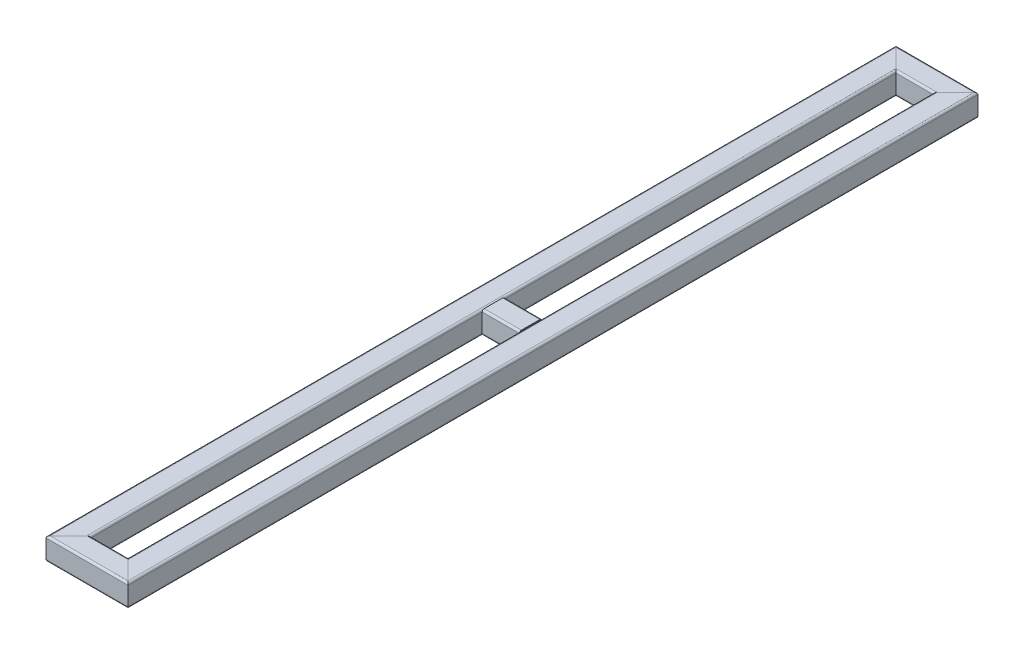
ISO-10303-21;
HEADER;
FILE_DESCRIPTION(('STEP AP214'),'2;1');
FILE_NAME('part.step','',(''),(''),'','','');
FILE_SCHEMA(('AUTOMOTIVE_DESIGN { 1 0 10303 214 1 1 1 1 }'));
ENDSEC;
DATA;
#1=APPLICATION_CONTEXT('core data for automotive mechanical design processes');
#2=APPLICATION_PROTOCOL_DEFINITION('international standard','automotive_design',2000,#1);
#3=PRODUCT_CONTEXT('',#1,'mechanical');
#4=PRODUCT('Part','Part','',(#3));
#5=PRODUCT_RELATED_PRODUCT_CATEGORY('part','',(#4));
#6=PRODUCT_DEFINITION_FORMATION('','',#4);
#7=PRODUCT_DEFINITION_CONTEXT('part definition',#1,'design');
#8=PRODUCT_DEFINITION('design','',#6,#7);
#9=PRODUCT_DEFINITION_SHAPE('','',#8);
#10=(LENGTH_UNIT() NAMED_UNIT(*) SI_UNIT(.MILLI.,.METRE.));
#11=(NAMED_UNIT(*) PLANE_ANGLE_UNIT() SI_UNIT($,.RADIAN.));
#12=(NAMED_UNIT(*) SI_UNIT($,.STERADIAN.) SOLID_ANGLE_UNIT());
#13=UNCERTAINTY_MEASURE_WITH_UNIT(LENGTH_MEASURE(1.E-05),#10,'distance_accuracy_value','');
#14=(GEOMETRIC_REPRESENTATION_CONTEXT(3) GLOBAL_UNCERTAINTY_ASSIGNED_CONTEXT((#13)) GLOBAL_UNIT_ASSIGNED_CONTEXT((#10,
#11,#12)) REPRESENTATION_CONTEXT('',''));
#15=CARTESIAN_POINT('',(0.,0.,0.));
#16=DIRECTION('',(0.,0.,1.));
#17=DIRECTION('',(1.,0.,0.));
#18=AXIS2_PLACEMENT_3D('',#15,#16,#17);
#19=CARTESIAN_POINT('',(18.5,18.5,0.));
#20=DIRECTION('',(0.,0.,-1.));
#21=DIRECTION('',(0.,1.,0.));
#22=AXIS2_PLACEMENT_3D('',#19,#20,#21);
#23=CYLINDRICAL_SURFACE('',#22,4.);
#24=CARTESIAN_POINT('',(18.5,18.5000000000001,-1646.5));
#25=DIRECTION('',(0.707106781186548,0.,-0.707106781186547));
#26=DIRECTION('',(-0.707106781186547,0.,-0.707106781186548));
#27=AXIS2_PLACEMENT_3D('',#24,#25,#26);
#28=ELLIPSE('',#27,5.65685424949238,4.);
#29=CARTESIAN_POINT('',(18.4999999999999,22.5000000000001,-1646.5));
#30=VERTEX_POINT('',#29);
#31=CARTESIAN_POINT('',(22.5,18.5000000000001,-1642.5));
#32=VERTEX_POINT('',#31);
#33=EDGE_CURVE('E215',#30,#32,#28,.T.);
#34=ORIENTED_EDGE('',*,*,#33,.F.);
#35=DIRECTION('',(0.,0.,-1.));
#36=VECTOR('',#35,1.);
#37=CARTESIAN_POINT('',(18.5,22.5,0.));
#38=LINE('',#37,#36);
#39=CARTESIAN_POINT('',(18.5,22.5,-18.5));
#40=VERTEX_POINT('',#39);
#41=EDGE_CURVE('E295',#40,#30,#38,.T.);
#42=ORIENTED_EDGE('',*,*,#41,.F.);
#43=CARTESIAN_POINT('',(18.5,18.5,-18.5));
#44=DIRECTION('',(0.707106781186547,0.,0.707106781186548));
#45=DIRECTION('',(0.707106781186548,0.,-0.707106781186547));
#46=AXIS2_PLACEMENT_3D('',#43,#44,#45);
#47=ELLIPSE('',#46,5.65685424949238,4.);
#48=CARTESIAN_POINT('',(22.5,18.5000000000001,-22.5));
#49=VERTEX_POINT('',#48);
#50=EDGE_CURVE('E206',#49,#40,#47,.T.);
#51=ORIENTED_EDGE('',*,*,#50,.F.);
#52=DIRECTION('',(0.,0.,-1.));
#53=VECTOR('',#52,1.);
#54=CARTESIAN_POINT('',(22.5,18.5,0.));
#55=LINE('',#54,#53);
#56=EDGE_CURVE('E75',#49,#32,#55,.T.);
#57=ORIENTED_EDGE('',*,*,#56,.T.);
#58=EDGE_LOOP('',(#34,#42,#51,#57));
#59=FACE_BOUND('',#58,.T.);
#60=ADVANCED_FACE('F71',(#59),#23,.T.);
#61=CARTESIAN_POINT('',(18.5,22.5,0.));
#62=DIRECTION('',(0.,-1.,0.));
#63=DIRECTION('',(0.,0.,-1.));
#64=AXIS2_PLACEMENT_3D('',#61,#62,#63);
#65=PLANE('',#64);
#66=DIRECTION('',(0.707106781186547,0.,0.707106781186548));
#67=VECTOR('',#66,1.);
#68=CARTESIAN_POINT('',(841.75,22.5000000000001,-823.25));
#69=LINE('',#68,#67);
#70=CARTESIAN_POINT('',(-18.5,22.5000000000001,-1683.5));
#71=VERTEX_POINT('',#70);
#72=EDGE_CURVE('E212',#71,#30,#69,.T.);
#73=ORIENTED_EDGE('',*,*,#72,.F.);
#74=DIRECTION('',(0.,0.,-1.));
#75=VECTOR('',#74,1.);
#76=CARTESIAN_POINT('',(-18.5,22.5,0.));
#77=LINE('',#76,#75);
#78=CARTESIAN_POINT('',(-18.5,22.5,18.5));
#79=VERTEX_POINT('',#78);
#80=EDGE_CURVE('E293',#79,#71,#77,.T.);
#81=ORIENTED_EDGE('',*,*,#80,.F.);
#82=DIRECTION('',(-0.707106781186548,0.,0.707106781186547));
#83=VECTOR('',#82,1.);
#84=CARTESIAN_POINT('',(9.25000000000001,22.5,-9.25));
#85=LINE('',#84,#83);
#86=EDGE_CURVE('E311',#40,#79,#85,.T.);
#87=ORIENTED_EDGE('',*,*,#86,.F.);
#88=ORIENTED_EDGE('',*,*,#41,.T.);
#89=EDGE_LOOP('',(#73,#81,#87,#88));
#90=FACE_BOUND('',#89,.T.);
#91=ADVANCED_FACE('F302',(#90),#65,.F.);
#92=CARTESIAN_POINT('',(-18.5,18.5,0.));
#93=DIRECTION('',(0.,0.,-1.));
#94=DIRECTION('',(0.,1.,0.));
#95=AXIS2_PLACEMENT_3D('',#92,#93,#94);
#96=CYLINDRICAL_SURFACE('',#95,4.);
#97=CARTESIAN_POINT('',(-18.5,18.5000000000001,-1683.5));
#98=DIRECTION('',(0.707106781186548,0.,-0.707106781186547));
#99=DIRECTION('',(-0.707106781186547,0.,-0.707106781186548));
#100=AXIS2_PLACEMENT_3D('',#97,#98,#99);
#101=ELLIPSE('',#100,5.65685424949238,4.);
#102=CARTESIAN_POINT('',(-22.5,18.5000000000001,-1687.5));
#103=VERTEX_POINT('',#102);
#104=EDGE_CURVE('E13',#103,#71,#101,.T.);
#105=ORIENTED_EDGE('',*,*,#104,.F.);
#106=DIRECTION('',(0.,0.,-1.));
#107=VECTOR('',#106,1.);
#108=CARTESIAN_POINT('',(-22.5,18.5,0.));
#109=LINE('',#108,#107);
#110=CARTESIAN_POINT('',(-22.5,18.5,22.5));
#111=VERTEX_POINT('',#110);
#112=EDGE_CURVE('E290',#111,#103,#109,.T.);
#113=ORIENTED_EDGE('',*,*,#112,.F.);
#114=CARTESIAN_POINT('',(-18.5,18.5,18.5));
#115=DIRECTION('',(0.707106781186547,0.,0.707106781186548));
#116=DIRECTION('',(0.707106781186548,0.,-0.707106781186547));
#117=AXIS2_PLACEMENT_3D('',#114,#115,#116);
#118=ELLIPSE('',#117,5.65685424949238,4.);
#119=EDGE_CURVE('E308',#79,#111,#118,.T.);
#120=ORIENTED_EDGE('',*,*,#119,.F.);
#121=ORIENTED_EDGE('',*,*,#80,.T.);
#122=EDGE_LOOP('',(#105,#113,#120,#121));
#123=FACE_BOUND('',#122,.T.);
#124=ADVANCED_FACE('F305',(#123),#96,.T.);
#125=CARTESIAN_POINT('',(-22.5,-18.5,0.));
#126=DIRECTION('',(1.,0.,0.));
#127=DIRECTION('',(0.,0.,-1.));
#128=AXIS2_PLACEMENT_3D('',#125,#126,#127);
#129=PLANE('',#128);
#130=DIRECTION('',(0.,1.,0.));
#131=VECTOR('',#130,1.);
#132=CARTESIAN_POINT('',(-22.5,-18.5000000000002,-1687.5));
#133=LINE('',#132,#131);
#134=CARTESIAN_POINT('',(-22.5,-18.4999999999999,-1687.5));
#135=VERTEX_POINT('',#134);
#136=EDGE_CURVE('E81',#135,#103,#133,.T.);
#137=ORIENTED_EDGE('',*,*,#136,.F.);
#138=DIRECTION('',(0.,0.,-1.));
#139=VECTOR('',#138,1.);
#140=CARTESIAN_POINT('',(-22.5,-18.5,0.));
#141=LINE('',#140,#139);
#142=CARTESIAN_POINT('',(-22.5,-18.5,22.5));
#143=VERTEX_POINT('',#142);
#144=EDGE_CURVE('E287',#143,#135,#141,.T.);
#145=ORIENTED_EDGE('',*,*,#144,.F.);
#146=DIRECTION('',(0.,-1.,0.));
#147=VECTOR('',#146,1.);
#148=CARTESIAN_POINT('',(-22.5,-18.5,22.5));
#149=LINE('',#148,#147);
#150=EDGE_CURVE('E310',#111,#143,#149,.T.);
#151=ORIENTED_EDGE('',*,*,#150,.F.);
#152=ORIENTED_EDGE('',*,*,#112,.T.);
#153=EDGE_LOOP('',(#137,#145,#151,#152));
#154=FACE_BOUND('',#153,.T.);
#155=ADVANCED_FACE('F321',(#154),#129,.F.);
#156=CARTESIAN_POINT('',(-18.5,-18.5,0.));
#157=DIRECTION('',(0.,0.,-1.));
#158=DIRECTION('',(0.,1.,0.));
#159=AXIS2_PLACEMENT_3D('',#156,#157,#158);
#160=CYLINDRICAL_SURFACE('',#159,4.);
#161=CARTESIAN_POINT('',(-18.5,-18.4999999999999,-1683.5));
#162=DIRECTION('',(0.707106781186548,0.,-0.707106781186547));
#163=DIRECTION('',(-0.707106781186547,0.,-0.707106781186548));
#164=AXIS2_PLACEMENT_3D('',#161,#162,#163);
#165=ELLIPSE('',#164,5.65685424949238,4.);
#166=CARTESIAN_POINT('',(-18.5000000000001,-22.4999999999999,-1683.5));
#167=VERTEX_POINT('',#166);
#168=EDGE_CURVE('E230',#167,#135,#165,.T.);
#169=ORIENTED_EDGE('',*,*,#168,.F.);
#170=DIRECTION('',(0.,0.,-1.));
#171=VECTOR('',#170,1.);
#172=CARTESIAN_POINT('',(-18.5,-22.5,0.));
#173=LINE('',#172,#171);
#174=CARTESIAN_POINT('',(-18.5,-22.5,18.5));
#175=VERTEX_POINT('',#174);
#176=EDGE_CURVE('E284',#175,#167,#173,.T.);
#177=ORIENTED_EDGE('',*,*,#176,.F.);
#178=CARTESIAN_POINT('',(-18.5,-18.5,18.5));
#179=DIRECTION('',(0.707106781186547,0.,0.707106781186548));
#180=DIRECTION('',(0.707106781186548,0.,-0.707106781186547));
#181=AXIS2_PLACEMENT_3D('',#178,#179,#180);
#182=ELLIPSE('',#181,5.65685424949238,4.);
#183=EDGE_CURVE('E217',#143,#175,#182,.T.);
#184=ORIENTED_EDGE('',*,*,#183,.F.);
#185=ORIENTED_EDGE('',*,*,#144,.T.);
#186=EDGE_LOOP('',(#169,#177,#184,#185));
#187=FACE_BOUND('',#186,.T.);
#188=ADVANCED_FACE('F319',(#187),#160,.T.);
#189=CARTESIAN_POINT('',(-18.5,-22.5,0.));
#190=DIRECTION('',(0.,1.,0.));
#191=DIRECTION('',(0.,0.,1.));
#192=AXIS2_PLACEMENT_3D('',#189,#190,#191);
#193=PLANE('',#192);
#194=DIRECTION('',(-0.707106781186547,0.,-0.707106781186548));
#195=VECTOR('',#194,1.);
#196=CARTESIAN_POINT('',(823.25,-22.4999999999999,-841.75));
#197=LINE('',#196,#195);
#198=CARTESIAN_POINT('',(18.5,-22.4999999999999,-1646.5));
#199=VERTEX_POINT('',#198);
#200=EDGE_CURVE('E233',#199,#167,#197,.T.);
#201=ORIENTED_EDGE('',*,*,#200,.F.);
#202=DIRECTION('',(0.,0.,-1.));
#203=VECTOR('',#202,1.);
#204=CARTESIAN_POINT('',(18.5,-22.5,0.));
#205=LINE('',#204,#203);
#206=CARTESIAN_POINT('',(18.5,-22.5,-18.5));
#207=VERTEX_POINT('',#206);
#208=EDGE_CURVE('E282',#207,#199,#205,.T.);
#209=ORIENTED_EDGE('',*,*,#208,.F.);
#210=DIRECTION('',(0.707106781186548,0.,-0.707106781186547));
#211=VECTOR('',#210,1.);
#212=CARTESIAN_POINT('',(-9.25000000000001,-22.5,9.25));
#213=LINE('',#212,#211);
#214=EDGE_CURVE('E211',#175,#207,#213,.T.);
#215=ORIENTED_EDGE('',*,*,#214,.F.);
#216=ORIENTED_EDGE('',*,*,#176,.T.);
#217=EDGE_LOOP('',(#201,#209,#215,#216));
#218=FACE_BOUND('',#217,.T.);
#219=ADVANCED_FACE('F323',(#218),#193,.F.);
#220=CARTESIAN_POINT('',(18.5,-18.5,0.));
#221=DIRECTION('',(0.,0.,-1.));
#222=DIRECTION('',(0.,1.,0.));
#223=AXIS2_PLACEMENT_3D('',#220,#221,#222);
#224=CYLINDRICAL_SURFACE('',#223,4.);
#225=CARTESIAN_POINT('',(18.5,-18.4999999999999,-1646.5));
#226=DIRECTION('',(0.707106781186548,0.,-0.707106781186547));
#227=DIRECTION('',(-0.707106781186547,0.,-0.707106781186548));
#228=AXIS2_PLACEMENT_3D('',#225,#226,#227);
#229=ELLIPSE('',#228,5.65685424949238,4.);
#230=CARTESIAN_POINT('',(22.5,-18.5000000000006,-1642.5));
#231=VERTEX_POINT('',#230);
#232=EDGE_CURVE('E194',#231,#199,#229,.T.);
#233=ORIENTED_EDGE('',*,*,#232,.F.);
#234=DIRECTION('',(0.,0.,-1.));
#235=VECTOR('',#234,1.);
#236=CARTESIAN_POINT('',(22.5,-18.5,0.));
#237=LINE('',#236,#235);
#238=CARTESIAN_POINT('',(22.5,-18.5,-22.5));
#239=VERTEX_POINT('',#238);
#240=EDGE_CURVE('E186',#239,#231,#237,.T.);
#241=ORIENTED_EDGE('',*,*,#240,.F.);
#242=CARTESIAN_POINT('',(18.5,-18.5,-18.5));
#243=DIRECTION('',(0.707106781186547,0.,0.707106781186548));
#244=DIRECTION('',(0.707106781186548,0.,-0.707106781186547));
#245=AXIS2_PLACEMENT_3D('',#242,#243,#244);
#246=ELLIPSE('',#245,5.65685424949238,4.);
#247=EDGE_CURVE('E191',#207,#239,#246,.T.);
#248=ORIENTED_EDGE('',*,*,#247,.F.);
#249=ORIENTED_EDGE('',*,*,#208,.T.);
#250=EDGE_LOOP('',(#233,#241,#248,#249));
#251=FACE_BOUND('',#250,.T.);
#252=ADVANCED_FACE('F188',(#251),#224,.T.);
#253=CARTESIAN_POINT('',(-18.5,18.5,0.));
#254=DIRECTION('',(0.,0.,-1.));
#255=DIRECTION('',(0.,1.,0.));
#256=AXIS2_PLACEMENT_3D('',#253,#254,#255);
#257=CYLINDRICAL_SURFACE('',#256,1.99999999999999);
#258=DIRECTION('',(0.,0.,-1.));
#259=VECTOR('',#258,1.);
#260=CARTESIAN_POINT('',(-20.5,18.5,0.));
#261=LINE('',#260,#259);
#262=CARTESIAN_POINT('',(-20.5,18.5000000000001,20.5));
#263=VERTEX_POINT('',#262);
#264=CARTESIAN_POINT('',(-20.5,18.5000000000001,-1685.5));
#265=VERTEX_POINT('',#264);
#266=EDGE_CURVE('E239',#263,#265,#261,.T.);
#267=ORIENTED_EDGE('',*,*,#266,.T.);
#268=CARTESIAN_POINT('',(-18.5,18.5000000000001,-1683.5));
#269=DIRECTION('',(0.707106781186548,0.,-0.707106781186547));
#270=DIRECTION('',(-0.707106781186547,0.,-0.707106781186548));
#271=AXIS2_PLACEMENT_3D('',#268,#269,#270);
#272=ELLIPSE('',#271,2.82842712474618,1.99999999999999);
#273=CARTESIAN_POINT('',(-18.5,20.5000000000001,-1683.5));
#274=VERTEX_POINT('',#273);
#275=EDGE_CURVE('E117',#265,#274,#272,.T.);
#276=ORIENTED_EDGE('',*,*,#275,.T.);
#277=DIRECTION('',(0.,0.,-1.));
#278=VECTOR('',#277,1.);
#279=CARTESIAN_POINT('',(-18.5,20.5,0.));
#280=LINE('',#279,#278);
#281=CARTESIAN_POINT('',(-18.5,20.5,18.5));
#282=VERTEX_POINT('',#281);
#283=EDGE_CURVE('E242',#282,#274,#280,.T.);
#284=ORIENTED_EDGE('',*,*,#283,.F.);
#285=CARTESIAN_POINT('',(-18.5,18.5,18.5));
#286=DIRECTION('',(0.707106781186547,0.,0.707106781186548));
#287=DIRECTION('',(0.707106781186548,0.,-0.707106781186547));
#288=AXIS2_PLACEMENT_3D('',#285,#286,#287);
#289=ELLIPSE('',#288,2.82842712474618,1.99999999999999);
#290=EDGE_CURVE('E238',#282,#263,#289,.T.);
#291=ORIENTED_EDGE('',*,*,#290,.T.);
#292=EDGE_LOOP('',(#267,#276,#284,#291));
#293=FACE_BOUND('',#292,.T.);
#294=ADVANCED_FACE('F330',(#293),#257,.F.);
#295=CARTESIAN_POINT('',(18.5,20.5,0.));
#296=DIRECTION('',(0.,-1.,0.));
#297=DIRECTION('',(0.,0.,-1.));
#298=AXIS2_PLACEMENT_3D('',#295,#296,#297);
#299=PLANE('',#298);
#300=ORIENTED_EDGE('',*,*,#283,.T.);
#301=DIRECTION('',(0.707106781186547,0.,0.707106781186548));
#302=VECTOR('',#301,1.);
#303=CARTESIAN_POINT('',(841.75,20.5000000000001,-823.25));
#304=LINE('',#303,#302);
#305=CARTESIAN_POINT('',(18.5,20.5000000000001,-1646.5));
#306=VERTEX_POINT('',#305);
#307=EDGE_CURVE('E90',#274,#306,#304,.T.);
#308=ORIENTED_EDGE('',*,*,#307,.T.);
#309=DIRECTION('',(0.,0.,-1.));
#310=VECTOR('',#309,1.);
#311=CARTESIAN_POINT('',(18.5,20.5,0.));
#312=LINE('',#311,#310);
#313=CARTESIAN_POINT('',(18.5,20.5,-18.5));
#314=VERTEX_POINT('',#313);
#315=EDGE_CURVE('E247',#314,#306,#312,.T.);
#316=ORIENTED_EDGE('',*,*,#315,.F.);
#317=DIRECTION('',(-0.707106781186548,0.,0.707106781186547));
#318=VECTOR('',#317,1.);
#319=CARTESIAN_POINT('',(9.25000000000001,20.5,-9.25));
#320=LINE('',#319,#318);
#321=EDGE_CURVE('E241',#314,#282,#320,.T.);
#322=ORIENTED_EDGE('',*,*,#321,.T.);
#323=EDGE_LOOP('',(#300,#308,#316,#322));
#324=FACE_BOUND('',#323,.T.);
#325=ADVANCED_FACE('F372',(#324),#299,.T.);
#326=CARTESIAN_POINT('',(18.5,18.5,0.));
#327=DIRECTION('',(0.,0.,-1.));
#328=DIRECTION('',(0.,1.,0.));
#329=AXIS2_PLACEMENT_3D('',#326,#327,#328);
#330=CYLINDRICAL_SURFACE('',#329,1.99999999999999);
#331=ORIENTED_EDGE('',*,*,#315,.T.);
#332=CARTESIAN_POINT('',(18.5,18.5000000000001,-1646.5));
#333=DIRECTION('',(0.707106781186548,0.,-0.707106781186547));
#334=DIRECTION('',(-0.707106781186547,0.,-0.707106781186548));
#335=AXIS2_PLACEMENT_3D('',#332,#333,#334);
#336=ELLIPSE('',#335,2.82842712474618,1.99999999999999);
#337=CARTESIAN_POINT('',(20.5,18.5000000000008,-1644.5));
#338=VERTEX_POINT('',#337);
#339=EDGE_CURVE('E243',#306,#338,#336,.T.);
#340=ORIENTED_EDGE('',*,*,#339,.T.);
#341=DIRECTION('',(0.,0.,-1.));
#342=VECTOR('',#341,1.);
#343=CARTESIAN_POINT('',(20.5,18.5,0.));
#344=LINE('',#343,#342);
#345=CARTESIAN_POINT('',(20.5,18.5000000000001,-20.5));
#346=VERTEX_POINT('',#345);
#347=EDGE_CURVE('E252',#346,#338,#344,.T.);
#348=ORIENTED_EDGE('',*,*,#347,.F.);
#349=CARTESIAN_POINT('',(18.5,18.5,-18.5));
#350=DIRECTION('',(0.707106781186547,0.,0.707106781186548));
#351=DIRECTION('',(0.707106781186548,0.,-0.707106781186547));
#352=AXIS2_PLACEMENT_3D('',#349,#350,#351);
#353=ELLIPSE('',#352,2.82842712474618,1.99999999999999);
#354=EDGE_CURVE('E246',#346,#314,#353,.T.);
#355=ORIENTED_EDGE('',*,*,#354,.T.);
#356=EDGE_LOOP('',(#331,#340,#348,#355));
#357=FACE_BOUND('',#356,.T.);
#358=ADVANCED_FACE('F383',(#357),#330,.F.);
#359=CARTESIAN_POINT('',(20.5,18.5,0.));
#360=DIRECTION('',(-1.,0.,0.));
#361=DIRECTION('',(0.,0.,1.));
#362=AXIS2_PLACEMENT_3D('',#359,#360,#361);
#363=PLANE('',#362);
#364=ORIENTED_EDGE('',*,*,#347,.T.);
#365=DIRECTION('',(0.,-1.,0.));
#366=VECTOR('',#365,1.);
#367=CARTESIAN_POINT('',(20.5,18.4999999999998,-1644.5));
#368=LINE('',#367,#366);
#369=CARTESIAN_POINT('',(20.5,-18.4999999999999,-1644.5));
#370=VERTEX_POINT('',#369);
#371=EDGE_CURVE('E248',#338,#370,#368,.T.);
#372=ORIENTED_EDGE('',*,*,#371,.T.);
#373=DIRECTION('',(0.,0.,-1.));
#374=VECTOR('',#373,1.);
#375=CARTESIAN_POINT('',(20.5,-18.5,0.));
#376=LINE('',#375,#374);
#377=CARTESIAN_POINT('',(20.5,-18.5,-20.5));
#378=VERTEX_POINT('',#377);
#379=EDGE_CURVE('E257',#378,#370,#376,.T.);
#380=ORIENTED_EDGE('',*,*,#379,.F.);
#381=DIRECTION('',(0.,1.,0.));
#382=VECTOR('',#381,1.);
#383=CARTESIAN_POINT('',(20.5,18.5,-20.5));
#384=LINE('',#383,#382);
#385=EDGE_CURVE('E251',#378,#346,#384,.T.);
#386=ORIENTED_EDGE('',*,*,#385,.T.);
#387=EDGE_LOOP('',(#364,#372,#380,#386));
#388=FACE_BOUND('',#387,.T.);
#389=ADVANCED_FACE('F394',(#388),#363,.T.);
#390=CARTESIAN_POINT('',(18.5,-18.5,0.));
#391=DIRECTION('',(0.,0.,-1.));
#392=DIRECTION('',(0.,1.,0.));
#393=AXIS2_PLACEMENT_3D('',#390,#391,#392);
#394=CYLINDRICAL_SURFACE('',#393,2.);
#395=ORIENTED_EDGE('',*,*,#379,.T.);
#396=CARTESIAN_POINT('',(18.5,-18.4999999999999,-1646.5));
#397=DIRECTION('',(0.707106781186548,0.,-0.707106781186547));
#398=DIRECTION('',(-0.707106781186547,0.,-0.707106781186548));
#399=AXIS2_PLACEMENT_3D('',#396,#397,#398);
#400=ELLIPSE('',#399,2.82842712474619,2.);
#401=CARTESIAN_POINT('',(18.5,-20.4999999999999,-1646.5));
#402=VERTEX_POINT('',#401);
#403=EDGE_CURVE('E253',#370,#402,#400,.T.);
#404=ORIENTED_EDGE('',*,*,#403,.T.);
#405=DIRECTION('',(0.,0.,-1.));
#406=VECTOR('',#405,1.);
#407=CARTESIAN_POINT('',(18.5,-20.5,0.));
#408=LINE('',#407,#406);
#409=CARTESIAN_POINT('',(18.5,-20.5,-18.5));
#410=VERTEX_POINT('',#409);
#411=EDGE_CURVE('E262',#410,#402,#408,.T.);
#412=ORIENTED_EDGE('',*,*,#411,.F.);
#413=CARTESIAN_POINT('',(18.5,-18.5,-18.5));
#414=DIRECTION('',(0.707106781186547,0.,0.707106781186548));
#415=DIRECTION('',(0.707106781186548,0.,-0.707106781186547));
#416=AXIS2_PLACEMENT_3D('',#413,#414,#415);
#417=ELLIPSE('',#416,2.82842712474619,2.);
#418=EDGE_CURVE('E256',#410,#378,#417,.T.);
#419=ORIENTED_EDGE('',*,*,#418,.T.);
#420=EDGE_LOOP('',(#395,#404,#412,#419));
#421=FACE_BOUND('',#420,.T.);
#422=ADVANCED_FACE('F405',(#421),#394,.F.);
#423=CARTESIAN_POINT('',(-18.5,-20.5,0.));
#424=DIRECTION('',(0.,1.,0.));
#425=DIRECTION('',(0.,0.,1.));
#426=AXIS2_PLACEMENT_3D('',#423,#424,#425);
#427=PLANE('',#426);
#428=ORIENTED_EDGE('',*,*,#411,.T.);
#429=DIRECTION('',(-0.707106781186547,0.,-0.707106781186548));
#430=VECTOR('',#429,1.);
#431=CARTESIAN_POINT('',(823.25,-20.4999999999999,-841.75));
#432=LINE('',#431,#430);
#433=CARTESIAN_POINT('',(-18.5,-20.4999999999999,-1683.5));
#434=VERTEX_POINT('',#433);
#435=EDGE_CURVE('E258',#402,#434,#432,.T.);
#436=ORIENTED_EDGE('',*,*,#435,.T.);
#437=DIRECTION('',(0.,0.,-1.));
#438=VECTOR('',#437,1.);
#439=CARTESIAN_POINT('',(-18.5,-20.5,0.));
#440=LINE('',#439,#438);
#441=CARTESIAN_POINT('',(-18.5,-20.5,18.5));
#442=VERTEX_POINT('',#441);
#443=EDGE_CURVE('E266',#442,#434,#440,.T.);
#444=ORIENTED_EDGE('',*,*,#443,.F.);
#445=DIRECTION('',(0.707106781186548,0.,-0.707106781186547));
#446=VECTOR('',#445,1.);
#447=CARTESIAN_POINT('',(-9.25000000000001,-20.5,9.25));
#448=LINE('',#447,#446);
#449=EDGE_CURVE('E261',#442,#410,#448,.T.);
#450=ORIENTED_EDGE('',*,*,#449,.T.);
#451=EDGE_LOOP('',(#428,#436,#444,#450));
#452=FACE_BOUND('',#451,.T.);
#453=ADVANCED_FACE('F416',(#452),#427,.T.);
#454=CARTESIAN_POINT('',(-18.5,-18.5,0.));
#455=DIRECTION('',(0.,0.,-1.));
#456=DIRECTION('',(0.,1.,0.));
#457=AXIS2_PLACEMENT_3D('',#454,#455,#456);
#458=CYLINDRICAL_SURFACE('',#457,2.);
#459=ORIENTED_EDGE('',*,*,#443,.T.);
#460=CARTESIAN_POINT('',(-18.5,-18.4999999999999,-1683.5));
#461=DIRECTION('',(0.707106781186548,0.,-0.707106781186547));
#462=DIRECTION('',(-0.707106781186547,0.,-0.707106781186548));
#463=AXIS2_PLACEMENT_3D('',#460,#461,#462);
#464=ELLIPSE('',#463,2.82842712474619,2.);
#465=CARTESIAN_POINT('',(-20.5,-18.5000000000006,-1685.5));
#466=VERTEX_POINT('',#465);
#467=EDGE_CURVE('E263',#434,#466,#464,.T.);
#468=ORIENTED_EDGE('',*,*,#467,.T.);
#469=DIRECTION('',(0.,0.,-1.));
#470=VECTOR('',#469,1.);
#471=CARTESIAN_POINT('',(-20.5,-18.5,0.));
#472=LINE('',#471,#470);
#473=CARTESIAN_POINT('',(-20.5,-18.5,20.5));
#474=VERTEX_POINT('',#473);
#475=EDGE_CURVE('E224',#474,#466,#472,.T.);
#476=ORIENTED_EDGE('',*,*,#475,.F.);
#477=CARTESIAN_POINT('',(-18.5,-18.5,18.5));
#478=DIRECTION('',(0.707106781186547,0.,0.707106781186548));
#479=DIRECTION('',(0.707106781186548,0.,-0.707106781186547));
#480=AXIS2_PLACEMENT_3D('',#477,#478,#479);
#481=ELLIPSE('',#480,2.82842712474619,2.);
#482=EDGE_CURVE('E265',#474,#442,#481,.T.);
#483=ORIENTED_EDGE('',*,*,#482,.T.);
#484=EDGE_LOOP('',(#459,#468,#476,#483));
#485=FACE_BOUND('',#484,.T.);
#486=ADVANCED_FACE('F427',(#485),#458,.F.);
#487=CARTESIAN_POINT('',(-20.5,-18.5,0.));
#488=DIRECTION('',(1.,0.,0.));
#489=DIRECTION('',(0.,0.,-1.));
#490=AXIS2_PLACEMENT_3D('',#487,#488,#489);
#491=PLANE('',#490);
#492=ORIENTED_EDGE('',*,*,#475,.T.);
#493=DIRECTION('',(0.,1.,0.));
#494=VECTOR('',#493,1.);
#495=CARTESIAN_POINT('',(-20.5,-18.5000000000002,-1685.5));
#496=LINE('',#495,#494);
#497=EDGE_CURVE('E112',#466,#265,#496,.T.);
#498=ORIENTED_EDGE('',*,*,#497,.T.);
#499=ORIENTED_EDGE('',*,*,#266,.F.);
#500=DIRECTION('',(0.,-1.,0.));
#501=VECTOR('',#500,1.);
#502=CARTESIAN_POINT('',(-20.5,-18.5,20.5));
#503=LINE('',#502,#501);
#504=EDGE_CURVE('E199',#263,#474,#503,.T.);
#505=ORIENTED_EDGE('',*,*,#504,.T.);
#506=EDGE_LOOP('',(#492,#498,#499,#505));
#507=FACE_BOUND('',#506,.T.);
#508=ADVANCED_FACE('F438',(#507),#491,.T.);
#509=CARTESIAN_POINT('',(22.5,18.5,0.));
#510=DIRECTION('',(-1.,0.,0.));
#511=DIRECTION('',(0.,0.,1.));
#512=AXIS2_PLACEMENT_3D('',#509,#510,#511);
#513=PLANE('',#512);
#514=DIRECTION('',(0.,-1.,0.));
#515=VECTOR('',#514,1.);
#516=CARTESIAN_POINT('',(22.5,18.4999999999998,-1642.5));
#517=LINE('',#516,#515);
#518=EDGE_CURVE('E226',#32,#231,#517,.T.);
#519=ORIENTED_EDGE('',*,*,#518,.F.);
#520=ORIENTED_EDGE('',*,*,#56,.F.);
#521=DIRECTION('',(0.,1.,0.));
#522=VECTOR('',#521,1.);
#523=CARTESIAN_POINT('',(22.5,18.5,-22.5));
#524=LINE('',#523,#522);
#525=EDGE_CURVE('E198',#239,#49,#524,.T.);
#526=ORIENTED_EDGE('',*,*,#525,.F.);
#527=ORIENTED_EDGE('',*,*,#240,.T.);
#528=EDGE_LOOP('',(#519,#520,#526,#527));
#529=FACE_BOUND('',#528,.T.);
#530=ADVANCED_FACE('F202',(#529),#513,.F.);
#531=CARTESIAN_POINT('',(0.,0.,0.));
#532=DIRECTION('',(0.707106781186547,0.,0.707106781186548));
#533=DIRECTION('',(0.707106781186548,0.,-0.707106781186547));
#534=AXIS2_PLACEMENT_3D('',#531,#532,#533);
#535=PLANE('',#534);
#536=ORIENTED_EDGE('',*,*,#290,.F.);
#537=ORIENTED_EDGE('',*,*,#321,.F.);
#538=ORIENTED_EDGE('',*,*,#354,.F.);
#539=ORIENTED_EDGE('',*,*,#385,.F.);
#540=ORIENTED_EDGE('',*,*,#418,.F.);
#541=ORIENTED_EDGE('',*,*,#449,.F.);
#542=ORIENTED_EDGE('',*,*,#482,.F.);
#543=ORIENTED_EDGE('',*,*,#504,.F.);
#544=EDGE_LOOP('',(#536,#537,#538,#539,#540,#541,#542,#543));
#545=FACE_BOUND('',#544,.T.);
#546=ORIENTED_EDGE('',*,*,#525,.T.);
#547=ORIENTED_EDGE('',*,*,#50,.T.);
#548=ORIENTED_EDGE('',*,*,#86,.T.);
#549=ORIENTED_EDGE('',*,*,#119,.T.);
#550=ORIENTED_EDGE('',*,*,#150,.T.);
#551=ORIENTED_EDGE('',*,*,#183,.T.);
#552=ORIENTED_EDGE('',*,*,#214,.T.);
#553=ORIENTED_EDGE('',*,*,#247,.T.);
#554=EDGE_LOOP('',(#546,#547,#548,#549,#550,#551,#552,#553));
#555=FACE_BOUND('',#554,.T.);
#556=ADVANCED_FACE('F209',(#545,#555),#535,.T.);
#557=CARTESIAN_POINT('',(0.,1.24857152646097E-13,-1665.));
#558=DIRECTION('',(0.707106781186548,0.,-0.707106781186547));
#559=DIRECTION('',(-0.707106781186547,0.,-0.707106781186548));
#560=AXIS2_PLACEMENT_3D('',#557,#558,#559);
#561=PLANE('',#560);
#562=ORIENTED_EDGE('',*,*,#275,.F.);
#563=ORIENTED_EDGE('',*,*,#497,.F.);
#564=ORIENTED_EDGE('',*,*,#467,.F.);
#565=ORIENTED_EDGE('',*,*,#435,.F.);
#566=ORIENTED_EDGE('',*,*,#403,.F.);
#567=ORIENTED_EDGE('',*,*,#371,.F.);
#568=ORIENTED_EDGE('',*,*,#339,.F.);
#569=ORIENTED_EDGE('',*,*,#307,.F.);
#570=EDGE_LOOP('',(#562,#563,#564,#565,#566,#567,#568,#569));
#571=FACE_BOUND('',#570,.T.);
#572=ORIENTED_EDGE('',*,*,#72,.T.);
#573=ORIENTED_EDGE('',*,*,#33,.T.);
#574=ORIENTED_EDGE('',*,*,#518,.T.);
#575=ORIENTED_EDGE('',*,*,#232,.T.);
#576=ORIENTED_EDGE('',*,*,#200,.T.);
#577=ORIENTED_EDGE('',*,*,#168,.T.);
#578=ORIENTED_EDGE('',*,*,#136,.T.);
#579=ORIENTED_EDGE('',*,*,#104,.T.);
#580=EDGE_LOOP('',(#572,#573,#574,#575,#576,#577,#578,#579));
#581=FACE_BOUND('',#580,.T.);
#582=ADVANCED_FACE('F73',(#571,#581),#561,.T.);
#583=CLOSED_SHELL('',(#60,#91,#124,#155,#188,#219,#252,#294,#325,#358,#389,#422,#453,#486,#508,
#530,#556,#582));
#584=MANIFOLD_SOLID_BREP('B2',#583);
#585=CARTESIAN_POINT('',(1.11022302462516E-13,18.5000000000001,-1646.5));
#586=DIRECTION('',(1.,0.,0.));
#587=DIRECTION('',(0.,1.,0.));
#588=AXIS2_PLACEMENT_3D('',#585,#586,#587);
#589=CYLINDRICAL_SURFACE('',#588,4.);
#590=CARTESIAN_POINT('',(18.5000000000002,18.5000000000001,-1646.5));
#591=DIRECTION('',(-0.707106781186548,0.,0.707106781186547));
#592=DIRECTION('',(0.707106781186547,0.,0.707106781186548));
#593=AXIS2_PLACEMENT_3D('',#590,#591,#592);
#594=ELLIPSE('',#593,5.65685424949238,4.);
#595=CARTESIAN_POINT('',(22.5000000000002,18.5000000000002,-1642.5));
#596=VERTEX_POINT('',#595);
#597=CARTESIAN_POINT('',(18.5000000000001,22.5000000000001,-1646.5));
#598=VERTEX_POINT('',#597);
#599=EDGE_CURVE('E695',#596,#598,#594,.T.);
#600=ORIENTED_EDGE('',*,*,#599,.F.);
#601=DIRECTION('',(1.,0.,0.));
#602=VECTOR('',#601,1.);
#603=CARTESIAN_POINT('',(1.11022302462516E-13,18.5000000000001,-1642.5));
#604=LINE('',#603,#602);
#605=CARTESIAN_POINT('',(97.4999999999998,18.5000000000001,-1642.5));
#606=VERTEX_POINT('',#605);
#607=EDGE_CURVE('E571',#596,#606,#604,.T.);
#608=ORIENTED_EDGE('',*,*,#607,.T.);
#609=CARTESIAN_POINT('',(101.5,18.5000000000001,-1646.5));
#610=DIRECTION('',(0.707106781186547,0.,0.707106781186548));
#611=DIRECTION('',(0.707106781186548,0.,-0.707106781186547));
#612=AXIS2_PLACEMENT_3D('',#609,#610,#611);
#613=ELLIPSE('',#612,5.65685424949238,4.);
#614=CARTESIAN_POINT('',(101.5,22.5000000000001,-1646.5));
#615=VERTEX_POINT('',#614);
#616=EDGE_CURVE('E776',#615,#606,#613,.T.);
#617=ORIENTED_EDGE('',*,*,#616,.F.);
#618=DIRECTION('',(1.,0.,0.));
#619=VECTOR('',#618,1.);
#620=CARTESIAN_POINT('',(1.11022302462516E-13,22.5000000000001,-1646.5));
#621=LINE('',#620,#619);
#622=EDGE_CURVE('E769',#598,#615,#621,.T.);
#623=ORIENTED_EDGE('',*,*,#622,.F.);
#624=EDGE_LOOP('',(#600,#608,#617,#623));
#625=FACE_BOUND('',#624,.T.);
#626=ADVANCED_FACE('F567',(#625),#589,.T.);
#627=CARTESIAN_POINT('',(1.11022302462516E-13,22.5000000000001,-1646.5));
#628=DIRECTION('',(0.,-1.,0.));
#629=DIRECTION('',(0.,0.,-1.));
#630=AXIS2_PLACEMENT_3D('',#627,#628,#629);
#631=PLANE('',#630);
#632=DIRECTION('',(-0.707106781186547,0.,-0.707106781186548));
#633=VECTOR('',#632,1.);
#634=CARTESIAN_POINT('',(9.25000000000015,22.5000000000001,-1655.75));
#635=LINE('',#634,#633);
#636=CARTESIAN_POINT('',(-18.5,22.5000000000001,-1683.5));
#637=VERTEX_POINT('',#636);
#638=EDGE_CURVE('E713',#598,#637,#635,.T.);
#639=ORIENTED_EDGE('',*,*,#638,.F.);
#640=ORIENTED_EDGE('',*,*,#622,.T.);
#641=DIRECTION('',(-0.707106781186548,0.,0.707106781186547));
#642=VECTOR('',#641,1.);
#643=CARTESIAN_POINT('',(50.75,22.5000000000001,-1595.75));
#644=LINE('',#643,#642);
#645=CARTESIAN_POINT('',(138.5,22.5000000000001,-1683.5));
#646=VERTEX_POINT('',#645);
#647=EDGE_CURVE('E685',#646,#615,#644,.T.);
#648=ORIENTED_EDGE('',*,*,#647,.F.);
#649=DIRECTION('',(1.,0.,0.));
#650=VECTOR('',#649,1.);
#651=CARTESIAN_POINT('',(1.11022302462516E-13,22.5000000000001,-1683.5));
#652=LINE('',#651,#650);
#653=EDGE_CURVE('E768',#637,#646,#652,.T.);
#654=ORIENTED_EDGE('',*,*,#653,.F.);
#655=EDGE_LOOP('',(#639,#640,#648,#654));
#656=FACE_BOUND('',#655,.T.);
#657=ADVANCED_FACE('F823',(#656),#631,.F.);
#658=CARTESIAN_POINT('',(1.11022302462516E-13,18.5000000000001,-1683.5));
#659=DIRECTION('',(1.,0.,0.));
#660=DIRECTION('',(0.,1.,0.));
#661=AXIS2_PLACEMENT_3D('',#658,#659,#660);
#662=CYLINDRICAL_SURFACE('',#661,4.);
#663=CARTESIAN_POINT('',(-18.5,18.5000000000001,-1683.5));
#664=DIRECTION('',(-0.707106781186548,0.,0.707106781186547));
#665=DIRECTION('',(0.707106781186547,0.,0.707106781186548));
#666=AXIS2_PLACEMENT_3D('',#663,#664,#665);
#667=ELLIPSE('',#666,5.65685424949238,4.);
#668=CARTESIAN_POINT('',(-22.5,18.5000000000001,-1687.5));
#669=VERTEX_POINT('',#668);
#670=EDGE_CURVE('E710',#637,#669,#667,.T.);
#671=ORIENTED_EDGE('',*,*,#670,.F.);
#672=ORIENTED_EDGE('',*,*,#653,.T.);
#673=CARTESIAN_POINT('',(138.5,18.5000000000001,-1683.5));
#674=DIRECTION('',(0.707106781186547,0.,0.707106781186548));
#675=DIRECTION('',(0.707106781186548,0.,-0.707106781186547));
#676=AXIS2_PLACEMENT_3D('',#673,#674,#675);
#677=ELLIPSE('',#676,5.65685424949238,4.);
#678=CARTESIAN_POINT('',(142.5,18.5000000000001,-1687.5));
#679=VERTEX_POINT('',#678);
#680=EDGE_CURVE('E696',#679,#646,#677,.T.);
#681=ORIENTED_EDGE('',*,*,#680,.F.);
#682=DIRECTION('',(1.,0.,0.));
#683=VECTOR('',#682,1.);
#684=CARTESIAN_POINT('',(1.11022302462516E-13,18.5000000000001,-1687.5));
#685=LINE('',#684,#683);
#686=EDGE_CURVE('E766',#669,#679,#685,.T.);
#687=ORIENTED_EDGE('',*,*,#686,.F.);
#688=EDGE_LOOP('',(#671,#672,#681,#687));
#689=FACE_BOUND('',#688,.T.);
#690=ADVANCED_FACE('F821',(#689),#662,.T.);
#691=CARTESIAN_POINT('',(1.11022302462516E-13,-18.4999999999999,-1687.5));
#692=DIRECTION('',(0.,0.,1.));
#693=DIRECTION('',(0.,-1.,0.));
#694=AXIS2_PLACEMENT_3D('',#691,#692,#693);
#695=PLANE('',#694);
#696=DIRECTION('',(0.,-1.,0.));
#697=VECTOR('',#696,1.);
#698=CARTESIAN_POINT('',(-22.5,-18.4999999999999,-1687.5));
#699=LINE('',#698,#697);
#700=CARTESIAN_POINT('',(-22.5,-18.4999999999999,-1687.5));
#701=VERTEX_POINT('',#700);
#702=EDGE_CURVE('E705',#669,#701,#699,.T.);
#703=ORIENTED_EDGE('',*,*,#702,.F.);
#704=ORIENTED_EDGE('',*,*,#686,.T.);
#705=DIRECTION('',(0.,1.,0.));
#706=VECTOR('',#705,1.);
#707=CARTESIAN_POINT('',(142.5,-18.5,-1687.5));
#708=LINE('',#707,#706);
#709=CARTESIAN_POINT('',(142.5,-18.4999999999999,-1687.5));
#710=VERTEX_POINT('',#709);
#711=EDGE_CURVE('E815',#710,#679,#708,.T.);
#712=ORIENTED_EDGE('',*,*,#711,.F.);
#713=DIRECTION('',(1.,0.,0.));
#714=VECTOR('',#713,1.);
#715=CARTESIAN_POINT('',(1.11022302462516E-13,-18.4999999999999,-1687.5));
#716=LINE('',#715,#714);
#717=EDGE_CURVE('E764',#701,#710,#716,.T.);
#718=ORIENTED_EDGE('',*,*,#717,.F.);
#719=EDGE_LOOP('',(#703,#704,#712,#718));
#720=FACE_BOUND('',#719,.T.);
#721=ADVANCED_FACE('F830',(#720),#695,.F.);
#722=CARTESIAN_POINT('',(1.11022302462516E-13,-18.4999999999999,-1683.5));
#723=DIRECTION('',(1.,0.,0.));
#724=DIRECTION('',(0.,1.,0.));
#725=AXIS2_PLACEMENT_3D('',#722,#723,#724);
#726=CYLINDRICAL_SURFACE('',#725,4.);
#727=CARTESIAN_POINT('',(-18.5,-18.4999999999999,-1683.5));
#728=DIRECTION('',(-0.707106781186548,0.,0.707106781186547));
#729=DIRECTION('',(0.707106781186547,0.,0.707106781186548));
#730=AXIS2_PLACEMENT_3D('',#727,#728,#729);
#731=ELLIPSE('',#730,5.65685424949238,4.);
#732=CARTESIAN_POINT('',(-18.4999999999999,-22.4999999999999,-1683.5));
#733=VERTEX_POINT('',#732);
#734=EDGE_CURVE('E701',#701,#733,#731,.T.);
#735=ORIENTED_EDGE('',*,*,#734,.F.);
#736=ORIENTED_EDGE('',*,*,#717,.T.);
#737=CARTESIAN_POINT('',(138.5,-18.4999999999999,-1683.5));
#738=DIRECTION('',(0.707106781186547,0.,0.707106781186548));
#739=DIRECTION('',(0.707106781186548,0.,-0.707106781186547));
#740=AXIS2_PLACEMENT_3D('',#737,#738,#739);
#741=ELLIPSE('',#740,5.65685424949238,4.);
#742=CARTESIAN_POINT('',(138.5,-22.4999999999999,-1683.5));
#743=VERTEX_POINT('',#742);
#744=EDGE_CURVE('E812',#743,#710,#741,.T.);
#745=ORIENTED_EDGE('',*,*,#744,.F.);
#746=DIRECTION('',(1.,0.,0.));
#747=VECTOR('',#746,1.);
#748=CARTESIAN_POINT('',(1.11022302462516E-13,-22.4999999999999,-1683.5));
#749=LINE('',#748,#747);
#750=EDGE_CURVE('E762',#733,#743,#749,.T.);
#751=ORIENTED_EDGE('',*,*,#750,.F.);
#752=EDGE_LOOP('',(#735,#736,#745,#751));
#753=FACE_BOUND('',#752,.T.);
#754=ADVANCED_FACE('F835',(#753),#726,.T.);
#755=CARTESIAN_POINT('',(1.11022302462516E-13,-22.4999999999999,-1683.5));
#756=DIRECTION('',(0.,1.,0.));
#757=DIRECTION('',(0.,0.,1.));
#758=AXIS2_PLACEMENT_3D('',#755,#756,#757);
#759=PLANE('',#758);
#760=DIRECTION('',(0.707106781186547,0.,0.707106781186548));
#761=VECTOR('',#760,1.);
#762=CARTESIAN_POINT('',(-9.24999999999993,-22.4999999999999,-1674.25));
#763=LINE('',#762,#761);
#764=CARTESIAN_POINT('',(18.5000000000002,-22.4999999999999,-1646.5));
#765=VERTEX_POINT('',#764);
#766=EDGE_CURVE('E577',#733,#765,#763,.T.);
#767=ORIENTED_EDGE('',*,*,#766,.F.);
#768=ORIENTED_EDGE('',*,*,#750,.T.);
#769=DIRECTION('',(0.707106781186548,0.,-0.707106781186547));
#770=VECTOR('',#769,1.);
#771=CARTESIAN_POINT('',(69.25,-22.4999999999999,-1614.25));
#772=LINE('',#771,#770);
#773=CARTESIAN_POINT('',(101.5,-22.4999999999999,-1646.5));
#774=VERTEX_POINT('',#773);
#775=EDGE_CURVE('E809',#774,#743,#772,.T.);
#776=ORIENTED_EDGE('',*,*,#775,.F.);
#777=DIRECTION('',(1.,0.,0.));
#778=VECTOR('',#777,1.);
#779=CARTESIAN_POINT('',(1.11022302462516E-13,-22.4999999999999,-1646.5));
#780=LINE('',#779,#778);
#781=EDGE_CURVE('E720',#765,#774,#780,.T.);
#782=ORIENTED_EDGE('',*,*,#781,.F.);
#783=EDGE_LOOP('',(#767,#768,#776,#782));
#784=FACE_BOUND('',#783,.T.);
#785=ADVANCED_FACE('F839',(#784),#759,.F.);
#786=CARTESIAN_POINT('',(1.11022302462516E-13,-18.4999999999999,-1646.5));
#787=DIRECTION('',(1.,0.,0.));
#788=DIRECTION('',(0.,1.,0.));
#789=AXIS2_PLACEMENT_3D('',#786,#787,#788);
#790=CYLINDRICAL_SURFACE('',#789,4.);
#791=CARTESIAN_POINT('',(18.5000000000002,-18.4999999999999,-1646.5));
#792=DIRECTION('',(-0.707106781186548,0.,0.707106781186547));
#793=DIRECTION('',(0.707106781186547,0.,0.707106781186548));
#794=AXIS2_PLACEMENT_3D('',#791,#792,#793);
#795=ELLIPSE('',#794,5.65685424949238,4.);
#796=CARTESIAN_POINT('',(22.5000000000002,-18.4999999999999,-1642.5));
#797=VERTEX_POINT('',#796);
#798=EDGE_CURVE('E69',#765,#797,#795,.T.);
#799=ORIENTED_EDGE('',*,*,#798,.F.);
#800=ORIENTED_EDGE('',*,*,#781,.T.);
#801=CARTESIAN_POINT('',(101.5,-18.4999999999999,-1646.5));
#802=DIRECTION('',(0.707106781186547,0.,0.707106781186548));
#803=DIRECTION('',(0.707106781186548,0.,-0.707106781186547));
#804=AXIS2_PLACEMENT_3D('',#801,#802,#803);
#805=ELLIPSE('',#804,5.65685424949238,4.);
#806=CARTESIAN_POINT('',(97.4999999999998,-18.4999999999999,-1642.5));
#807=VERTEX_POINT('',#806);
#808=EDGE_CURVE('E681',#807,#774,#805,.T.);
#809=ORIENTED_EDGE('',*,*,#808,.F.);
#810=DIRECTION('',(1.,0.,0.));
#811=VECTOR('',#810,1.);
#812=CARTESIAN_POINT('',(1.11022302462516E-13,-18.4999999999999,-1642.5));
#813=LINE('',#812,#811);
#814=EDGE_CURVE('E676',#797,#807,#813,.T.);
#815=ORIENTED_EDGE('',*,*,#814,.F.);
#816=EDGE_LOOP('',(#799,#800,#809,#815));
#817=FACE_BOUND('',#816,.T.);
#818=ADVANCED_FACE('F678',(#817),#790,.T.);
#819=CARTESIAN_POINT('',(1.11022302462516E-13,18.5000000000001,-1683.5));
#820=DIRECTION('',(1.,0.,0.));
#821=DIRECTION('',(0.,1.,0.));
#822=AXIS2_PLACEMENT_3D('',#819,#820,#821);
#823=CYLINDRICAL_SURFACE('',#822,1.99999999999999);
#824=DIRECTION('',(1.,0.,0.));
#825=VECTOR('',#824,1.);
#826=CARTESIAN_POINT('',(1.11022302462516E-13,20.5000000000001,-1683.5));
#827=LINE('',#826,#825);
#828=CARTESIAN_POINT('',(-18.4999999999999,20.5000000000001,-1683.5));
#829=VERTEX_POINT('',#828);
#830=CARTESIAN_POINT('',(138.5,20.5000000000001,-1683.5));
#831=VERTEX_POINT('',#830);
#832=EDGE_CURVE('E724',#829,#831,#827,.T.);
#833=ORIENTED_EDGE('',*,*,#832,.F.);
#834=CARTESIAN_POINT('',(-18.5,18.5000000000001,-1683.5));
#835=DIRECTION('',(-0.707106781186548,0.,0.707106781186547));
#836=DIRECTION('',(0.707106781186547,0.,0.707106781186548));
#837=AXIS2_PLACEMENT_3D('',#834,#835,#836);
#838=ELLIPSE('',#837,2.82842712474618,1.99999999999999);
#839=CARTESIAN_POINT('',(-20.5,18.5000000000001,-1685.5));
#840=VERTEX_POINT('',#839);
#841=EDGE_CURVE('E717',#829,#840,#838,.T.);
#842=ORIENTED_EDGE('',*,*,#841,.T.);
#843=DIRECTION('',(1.,0.,0.));
#844=VECTOR('',#843,1.);
#845=CARTESIAN_POINT('',(1.11022302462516E-13,18.5000000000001,-1685.5));
#846=LINE('',#845,#844);
#847=CARTESIAN_POINT('',(140.5,18.5000000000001,-1685.5));
#848=VERTEX_POINT('',#847);
#849=EDGE_CURVE('E719',#840,#848,#846,.T.);
#850=ORIENTED_EDGE('',*,*,#849,.T.);
#851=CARTESIAN_POINT('',(138.5,18.5000000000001,-1683.5));
#852=DIRECTION('',(0.707106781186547,0.,0.707106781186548));
#853=DIRECTION('',(0.707106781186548,0.,-0.707106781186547));
#854=AXIS2_PLACEMENT_3D('',#851,#852,#853);
#855=ELLIPSE('',#854,2.82842712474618,1.99999999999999);
#856=EDGE_CURVE('E725',#848,#831,#855,.T.);
#857=ORIENTED_EDGE('',*,*,#856,.T.);
#858=EDGE_LOOP('',(#833,#842,#850,#857));
#859=FACE_BOUND('',#858,.T.);
#860=ADVANCED_FACE('F845',(#859),#823,.F.);
#861=CARTESIAN_POINT('',(1.11022302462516E-13,20.5000000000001,-1646.5));
#862=DIRECTION('',(0.,-1.,0.));
#863=DIRECTION('',(0.,0.,-1.));
#864=AXIS2_PLACEMENT_3D('',#861,#862,#863);
#865=PLANE('',#864);
#866=DIRECTION('',(1.,0.,0.));
#867=VECTOR('',#866,1.);
#868=CARTESIAN_POINT('',(1.11022302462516E-13,20.5000000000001,-1646.5));
#869=LINE('',#868,#867);
#870=CARTESIAN_POINT('',(18.5000000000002,20.5000000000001,-1646.5));
#871=VERTEX_POINT('',#870);
#872=CARTESIAN_POINT('',(101.5,20.5000000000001,-1646.5));
#873=VERTEX_POINT('',#872);
#874=EDGE_CURVE('E729',#871,#873,#869,.T.);
#875=ORIENTED_EDGE('',*,*,#874,.F.);
#876=DIRECTION('',(-0.707106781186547,0.,-0.707106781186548));
#877=VECTOR('',#876,1.);
#878=CARTESIAN_POINT('',(9.25000000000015,20.5000000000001,-1655.75));
#879=LINE('',#878,#877);
#880=EDGE_CURVE('E721',#871,#829,#879,.T.);
#881=ORIENTED_EDGE('',*,*,#880,.T.);
#882=ORIENTED_EDGE('',*,*,#832,.T.);
#883=DIRECTION('',(-0.707106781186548,0.,0.707106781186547));
#884=VECTOR('',#883,1.);
#885=CARTESIAN_POINT('',(50.75,20.5000000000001,-1595.75));
#886=LINE('',#885,#884);
#887=EDGE_CURVE('E730',#831,#873,#886,.T.);
#888=ORIENTED_EDGE('',*,*,#887,.T.);
#889=EDGE_LOOP('',(#875,#881,#882,#888));
#890=FACE_BOUND('',#889,.T.);
#891=ADVANCED_FACE('F851',(#890),#865,.T.);
#892=CARTESIAN_POINT('',(1.11022302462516E-13,18.5000000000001,-1646.5));
#893=DIRECTION('',(1.,0.,0.));
#894=DIRECTION('',(0.,1.,0.));
#895=AXIS2_PLACEMENT_3D('',#892,#893,#894);
#896=CYLINDRICAL_SURFACE('',#895,1.99999999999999);
#897=DIRECTION('',(1.,0.,0.));
#898=VECTOR('',#897,1.);
#899=CARTESIAN_POINT('',(1.11022302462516E-13,18.5000000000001,-1644.5));
#900=LINE('',#899,#898);
#901=CARTESIAN_POINT('',(20.5000000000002,18.5000000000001,-1644.5));
#902=VERTEX_POINT('',#901);
#903=CARTESIAN_POINT('',(99.4999999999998,18.5000000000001,-1644.5));
#904=VERTEX_POINT('',#903);
#905=EDGE_CURVE('E734',#902,#904,#900,.T.);
#906=ORIENTED_EDGE('',*,*,#905,.F.);
#907=CARTESIAN_POINT('',(18.5000000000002,18.5000000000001,-1646.5));
#908=DIRECTION('',(-0.707106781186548,0.,0.707106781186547));
#909=DIRECTION('',(0.707106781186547,0.,0.707106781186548));
#910=AXIS2_PLACEMENT_3D('',#907,#908,#909);
#911=ELLIPSE('',#910,2.82842712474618,1.99999999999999);
#912=EDGE_CURVE('E726',#902,#871,#911,.T.);
#913=ORIENTED_EDGE('',*,*,#912,.T.);
#914=ORIENTED_EDGE('',*,*,#874,.T.);
#915=CARTESIAN_POINT('',(101.5,18.5000000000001,-1646.5));
#916=DIRECTION('',(0.707106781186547,0.,0.707106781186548));
#917=DIRECTION('',(0.707106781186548,0.,-0.707106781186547));
#918=AXIS2_PLACEMENT_3D('',#915,#916,#917);
#919=ELLIPSE('',#918,2.82842712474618,1.99999999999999);
#920=EDGE_CURVE('E735',#873,#904,#919,.T.);
#921=ORIENTED_EDGE('',*,*,#920,.T.);
#922=EDGE_LOOP('',(#906,#913,#914,#921));
#923=FACE_BOUND('',#922,.T.);
#924=ADVANCED_FACE('F855',(#923),#896,.F.);
#925=CARTESIAN_POINT('',(1.11022302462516E-13,18.5000000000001,-1644.5));
#926=DIRECTION('',(0.,0.,-1.));
#927=DIRECTION('',(0.,1.,0.));
#928=AXIS2_PLACEMENT_3D('',#925,#926,#927);
#929=PLANE('',#928);
#930=DIRECTION('',(1.,0.,0.));
#931=VECTOR('',#930,1.);
#932=CARTESIAN_POINT('',(1.11022302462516E-13,-18.4999999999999,-1644.5));
#933=LINE('',#932,#931);
#934=CARTESIAN_POINT('',(20.5000000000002,-18.4999999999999,-1644.5));
#935=VERTEX_POINT('',#934);
#936=CARTESIAN_POINT('',(99.4999999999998,-18.4999999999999,-1644.5));
#937=VERTEX_POINT('',#936);
#938=EDGE_CURVE('E739',#935,#937,#933,.T.);
#939=ORIENTED_EDGE('',*,*,#938,.F.);
#940=DIRECTION('',(0.,1.,0.));
#941=VECTOR('',#940,1.);
#942=CARTESIAN_POINT('',(20.5000000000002,18.5000000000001,-1644.5));
#943=LINE('',#942,#941);
#944=EDGE_CURVE('E731',#935,#902,#943,.T.);
#945=ORIENTED_EDGE('',*,*,#944,.T.);
#946=ORIENTED_EDGE('',*,*,#905,.T.);
#947=DIRECTION('',(0.,-1.,0.));
#948=VECTOR('',#947,1.);
#949=CARTESIAN_POINT('',(99.4999999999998,18.5000000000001,-1644.5));
#950=LINE('',#949,#948);
#951=EDGE_CURVE('E740',#904,#937,#950,.T.);
#952=ORIENTED_EDGE('',*,*,#951,.T.);
#953=EDGE_LOOP('',(#939,#945,#946,#952));
#954=FACE_BOUND('',#953,.T.);
#955=ADVANCED_FACE('F859',(#954),#929,.T.);
#956=CARTESIAN_POINT('',(1.11022302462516E-13,-18.4999999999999,-1646.5));
#957=DIRECTION('',(1.,0.,0.));
#958=DIRECTION('',(0.,1.,0.));
#959=AXIS2_PLACEMENT_3D('',#956,#957,#958);
#960=CYLINDRICAL_SURFACE('',#959,2.);
#961=DIRECTION('',(1.,0.,0.));
#962=VECTOR('',#961,1.);
#963=CARTESIAN_POINT('',(1.11022302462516E-13,-20.4999999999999,-1646.5));
#964=LINE('',#963,#962);
#965=CARTESIAN_POINT('',(18.5000000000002,-20.4999999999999,-1646.5));
#966=VERTEX_POINT('',#965);
#967=CARTESIAN_POINT('',(101.5,-20.4999999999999,-1646.5));
#968=VERTEX_POINT('',#967);
#969=EDGE_CURVE('E744',#966,#968,#964,.T.);
#970=ORIENTED_EDGE('',*,*,#969,.F.);
#971=CARTESIAN_POINT('',(18.5000000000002,-18.4999999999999,-1646.5));
#972=DIRECTION('',(-0.707106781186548,0.,0.707106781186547));
#973=DIRECTION('',(0.707106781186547,0.,0.707106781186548));
#974=AXIS2_PLACEMENT_3D('',#971,#972,#973);
#975=ELLIPSE('',#974,2.82842712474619,2.);
#976=EDGE_CURVE('E736',#966,#935,#975,.T.);
#977=ORIENTED_EDGE('',*,*,#976,.T.);
#978=ORIENTED_EDGE('',*,*,#938,.T.);
#979=CARTESIAN_POINT('',(101.5,-18.4999999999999,-1646.5));
#980=DIRECTION('',(0.707106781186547,0.,0.707106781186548));
#981=DIRECTION('',(0.707106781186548,0.,-0.707106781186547));
#982=AXIS2_PLACEMENT_3D('',#979,#980,#981);
#983=ELLIPSE('',#982,2.82842712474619,2.);
#984=EDGE_CURVE('E745',#937,#968,#983,.T.);
#985=ORIENTED_EDGE('',*,*,#984,.T.);
#986=EDGE_LOOP('',(#970,#977,#978,#985));
#987=FACE_BOUND('',#986,.T.);
#988=ADVANCED_FACE('F863',(#987),#960,.F.);
#989=CARTESIAN_POINT('',(1.11022302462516E-13,-20.4999999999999,-1683.5));
#990=DIRECTION('',(0.,1.,0.));
#991=DIRECTION('',(0.,0.,1.));
#992=AXIS2_PLACEMENT_3D('',#989,#990,#991);
#993=PLANE('',#992);
#994=DIRECTION('',(1.,0.,0.));
#995=VECTOR('',#994,1.);
#996=CARTESIAN_POINT('',(1.11022302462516E-13,-20.4999999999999,-1683.5));
#997=LINE('',#996,#995);
#998=CARTESIAN_POINT('',(-18.5,-20.4999999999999,-1683.5));
#999=VERTEX_POINT('',#998);
#1000=CARTESIAN_POINT('',(138.5,-20.4999999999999,-1683.5));
#1001=VERTEX_POINT('',#1000);
#1002=EDGE_CURVE('E748',#999,#1001,#997,.T.);
#1003=ORIENTED_EDGE('',*,*,#1002,.F.);
#1004=DIRECTION('',(0.707106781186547,0.,0.707106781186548));
#1005=VECTOR('',#1004,1.);
#1006=CARTESIAN_POINT('',(-9.24999999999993,-20.4999999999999,-1674.25));
#1007=LINE('',#1006,#1005);
#1008=EDGE_CURVE('E741',#999,#966,#1007,.T.);
#1009=ORIENTED_EDGE('',*,*,#1008,.T.);
#1010=ORIENTED_EDGE('',*,*,#969,.T.);
#1011=DIRECTION('',(0.707106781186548,0.,-0.707106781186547));
#1012=VECTOR('',#1011,1.);
#1013=CARTESIAN_POINT('',(69.25,-20.4999999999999,-1614.25));
#1014=LINE('',#1013,#1012);
#1015=EDGE_CURVE('E749',#968,#1001,#1014,.T.);
#1016=ORIENTED_EDGE('',*,*,#1015,.T.);
#1017=EDGE_LOOP('',(#1003,#1009,#1010,#1016));
#1018=FACE_BOUND('',#1017,.T.);
#1019=ADVANCED_FACE('F867',(#1018),#993,.T.);
#1020=CARTESIAN_POINT('',(1.11022302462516E-13,-18.4999999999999,-1683.5));
#1021=DIRECTION('',(1.,0.,0.));
#1022=DIRECTION('',(0.,1.,0.));
#1023=AXIS2_PLACEMENT_3D('',#1020,#1021,#1022);
#1024=CYLINDRICAL_SURFACE('',#1023,2.);
#1025=DIRECTION('',(1.,0.,0.));
#1026=VECTOR('',#1025,1.);
#1027=CARTESIAN_POINT('',(1.11022302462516E-13,-18.4999999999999,-1685.5));
#1028=LINE('',#1027,#1026);
#1029=CARTESIAN_POINT('',(-20.5,-18.4999999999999,-1685.5));
#1030=VERTEX_POINT('',#1029);
#1031=CARTESIAN_POINT('',(140.5,-18.4999999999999,-1685.5));
#1032=VERTEX_POINT('',#1031);
#1033=EDGE_CURVE('E751',#1030,#1032,#1028,.T.);
#1034=ORIENTED_EDGE('',*,*,#1033,.F.);
#1035=CARTESIAN_POINT('',(-18.5,-18.4999999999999,-1683.5));
#1036=DIRECTION('',(-0.707106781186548,0.,0.707106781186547));
#1037=DIRECTION('',(0.707106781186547,0.,0.707106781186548));
#1038=AXIS2_PLACEMENT_3D('',#1035,#1036,#1037);
#1039=ELLIPSE('',#1038,2.82842712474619,2.);
#1040=EDGE_CURVE('E746',#1030,#999,#1039,.T.);
#1041=ORIENTED_EDGE('',*,*,#1040,.T.);
#1042=ORIENTED_EDGE('',*,*,#1002,.T.);
#1043=CARTESIAN_POINT('',(138.5,-18.4999999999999,-1683.5));
#1044=DIRECTION('',(0.707106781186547,0.,0.707106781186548));
#1045=DIRECTION('',(0.707106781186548,0.,-0.707106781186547));
#1046=AXIS2_PLACEMENT_3D('',#1043,#1044,#1045);
#1047=ELLIPSE('',#1046,2.82842712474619,2.);
#1048=EDGE_CURVE('E754',#1001,#1032,#1047,.T.);
#1049=ORIENTED_EDGE('',*,*,#1048,.T.);
#1050=EDGE_LOOP('',(#1034,#1041,#1042,#1049));
#1051=FACE_BOUND('',#1050,.T.);
#1052=ADVANCED_FACE('F871',(#1051),#1024,.F.);
#1053=CARTESIAN_POINT('',(1.11022302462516E-13,-18.4999999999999,-1685.5));
#1054=DIRECTION('',(0.,0.,1.));
#1055=DIRECTION('',(0.,-1.,0.));
#1056=AXIS2_PLACEMENT_3D('',#1053,#1054,#1055);
#1057=PLANE('',#1056);
#1058=ORIENTED_EDGE('',*,*,#849,.F.);
#1059=DIRECTION('',(0.,-1.,0.));
#1060=VECTOR('',#1059,1.);
#1061=CARTESIAN_POINT('',(-20.5,-18.4999999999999,-1685.5));
#1062=LINE('',#1061,#1060);
#1063=EDGE_CURVE('E585',#840,#1030,#1062,.T.);
#1064=ORIENTED_EDGE('',*,*,#1063,.T.);
#1065=ORIENTED_EDGE('',*,*,#1033,.T.);
#1066=DIRECTION('',(0.,1.,0.));
#1067=VECTOR('',#1066,1.);
#1068=CARTESIAN_POINT('',(140.5,-18.4999999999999,-1685.5));
#1069=LINE('',#1068,#1067);
#1070=EDGE_CURVE('E686',#1032,#848,#1069,.T.);
#1071=ORIENTED_EDGE('',*,*,#1070,.T.);
#1072=EDGE_LOOP('',(#1058,#1064,#1065,#1071));
#1073=FACE_BOUND('',#1072,.T.);
#1074=ADVANCED_FACE('F848',(#1073),#1057,.T.);
#1075=CARTESIAN_POINT('',(1.11022302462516E-13,18.5000000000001,-1642.5));
#1076=DIRECTION('',(0.,0.,-1.));
#1077=DIRECTION('',(0.,1.,0.));
#1078=AXIS2_PLACEMENT_3D('',#1075,#1076,#1077);
#1079=PLANE('',#1078);
#1080=DIRECTION('',(0.,1.,0.));
#1081=VECTOR('',#1080,1.);
#1082=CARTESIAN_POINT('',(22.5000000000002,18.5000000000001,-1642.5));
#1083=LINE('',#1082,#1081);
#1084=EDGE_CURVE('E690',#797,#596,#1083,.T.);
#1085=ORIENTED_EDGE('',*,*,#1084,.F.);
#1086=ORIENTED_EDGE('',*,*,#814,.T.);
#1087=DIRECTION('',(0.,-1.,0.));
#1088=VECTOR('',#1087,1.);
#1089=CARTESIAN_POINT('',(97.4999999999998,18.5000000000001,-1642.5));
#1090=LINE('',#1089,#1088);
#1091=EDGE_CURVE('E778',#606,#807,#1090,.T.);
#1092=ORIENTED_EDGE('',*,*,#1091,.F.);
#1093=ORIENTED_EDGE('',*,*,#607,.F.);
#1094=EDGE_LOOP('',(#1085,#1086,#1092,#1093));
#1095=FACE_BOUND('',#1094,.T.);
#1096=ADVANCED_FACE('F691',(#1095),#1079,.F.);
#1097=CARTESIAN_POINT('',(120.,1.21656555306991E-13,-1665.));
#1098=DIRECTION('',(0.707106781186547,0.,0.707106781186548));
#1099=DIRECTION('',(0.707106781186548,0.,-0.707106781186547));
#1100=AXIS2_PLACEMENT_3D('',#1097,#1098,#1099);
#1101=PLANE('',#1100);
#1102=ORIENTED_EDGE('',*,*,#856,.F.);
#1103=ORIENTED_EDGE('',*,*,#1070,.F.);
#1104=ORIENTED_EDGE('',*,*,#1048,.F.);
#1105=ORIENTED_EDGE('',*,*,#1015,.F.);
#1106=ORIENTED_EDGE('',*,*,#984,.F.);
#1107=ORIENTED_EDGE('',*,*,#951,.F.);
#1108=ORIENTED_EDGE('',*,*,#920,.F.);
#1109=ORIENTED_EDGE('',*,*,#887,.F.);
#1110=EDGE_LOOP('',(#1102,#1103,#1104,#1105,#1106,#1107,#1108,#1109));
#1111=FACE_BOUND('',#1110,.T.);
#1112=ORIENTED_EDGE('',*,*,#647,.T.);
#1113=ORIENTED_EDGE('',*,*,#616,.T.);
#1114=ORIENTED_EDGE('',*,*,#1091,.T.);
#1115=ORIENTED_EDGE('',*,*,#808,.T.);
#1116=ORIENTED_EDGE('',*,*,#775,.T.);
#1117=ORIENTED_EDGE('',*,*,#744,.T.);
#1118=ORIENTED_EDGE('',*,*,#711,.T.);
#1119=ORIENTED_EDGE('',*,*,#680,.T.);
#1120=EDGE_LOOP('',(#1112,#1113,#1114,#1115,#1116,#1117,#1118,#1119));
#1121=FACE_BOUND('',#1120,.T.);
#1122=ADVANCED_FACE('F781',(#1111,#1121),#1101,.T.);
#1123=CARTESIAN_POINT('',(0.,1.24857152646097E-13,-1665.));
#1124=DIRECTION('',(-0.707106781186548,0.,0.707106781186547));
#1125=DIRECTION('',(0.707106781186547,0.,0.707106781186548));
#1126=AXIS2_PLACEMENT_3D('',#1123,#1124,#1125);
#1127=PLANE('',#1126);
#1128=ORIENTED_EDGE('',*,*,#841,.F.);
#1129=ORIENTED_EDGE('',*,*,#880,.F.);
#1130=ORIENTED_EDGE('',*,*,#912,.F.);
#1131=ORIENTED_EDGE('',*,*,#944,.F.);
#1132=ORIENTED_EDGE('',*,*,#976,.F.);
#1133=ORIENTED_EDGE('',*,*,#1008,.F.);
#1134=ORIENTED_EDGE('',*,*,#1040,.F.);
#1135=ORIENTED_EDGE('',*,*,#1063,.F.);
#1136=EDGE_LOOP('',(#1128,#1129,#1130,#1131,#1132,#1133,#1134,#1135));
#1137=FACE_BOUND('',#1136,.T.);
#1138=ORIENTED_EDGE('',*,*,#1084,.T.);
#1139=ORIENTED_EDGE('',*,*,#599,.T.);
#1140=ORIENTED_EDGE('',*,*,#638,.T.);
#1141=ORIENTED_EDGE('',*,*,#670,.T.);
#1142=ORIENTED_EDGE('',*,*,#702,.T.);
#1143=ORIENTED_EDGE('',*,*,#734,.T.);
#1144=ORIENTED_EDGE('',*,*,#766,.T.);
#1145=ORIENTED_EDGE('',*,*,#798,.T.);
#1146=EDGE_LOOP('',(#1138,#1139,#1140,#1141,#1142,#1143,#1144,#1145));
#1147=FACE_BOUND('',#1146,.T.);
#1148=ADVANCED_FACE('F569',(#1137,#1147),#1127,.T.);
#1149=CLOSED_SHELL('',(#626,#657,#690,#721,#754,#785,#818,#860,#891,#924,#955,#988,#1019,#1052,
#1074,#1096,#1122,#1148));
#1150=MANIFOLD_SOLID_BREP('B7',#1149);
#1151=CARTESIAN_POINT('',(120.,18.5,-18.5));
#1152=DIRECTION('',(-1.,0.,0.));
#1153=DIRECTION('',(0.,-1.,0.));
#1154=AXIS2_PLACEMENT_3D('',#1151,#1152,#1153);
#1155=CYLINDRICAL_SURFACE('',#1154,4.);
#1156=CARTESIAN_POINT('',(18.5,18.5,-18.5));
#1157=DIRECTION('',(-0.707106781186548,0.,-0.707106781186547));
#1158=DIRECTION('',(-0.707106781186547,0.,0.707106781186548));
#1159=AXIS2_PLACEMENT_3D('',#1156,#1157,#1158);
#1160=ELLIPSE('',#1159,5.65685424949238,4.);
#1161=CARTESIAN_POINT('',(18.5,22.5,-18.5));
#1162=VERTEX_POINT('',#1161);
#1163=CARTESIAN_POINT('',(22.5,18.5,-22.5));
#1164=VERTEX_POINT('',#1163);
#1165=EDGE_CURVE('E1207',#1162,#1164,#1160,.T.);
#1166=ORIENTED_EDGE('',*,*,#1165,.F.);
#1167=DIRECTION('',(-1.,0.,0.));
#1168=VECTOR('',#1167,1.);
#1169=CARTESIAN_POINT('',(120.,22.5,-18.5));
#1170=LINE('',#1169,#1168);
#1171=CARTESIAN_POINT('',(101.5,22.5,-18.5));
#1172=VERTEX_POINT('',#1171);
#1173=EDGE_CURVE('E1287',#1172,#1162,#1170,.T.);
#1174=ORIENTED_EDGE('',*,*,#1173,.F.);
#1175=CARTESIAN_POINT('',(101.5,18.5,-18.5));
#1176=DIRECTION('',(0.707106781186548,0.,-0.707106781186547));
#1177=DIRECTION('',(-0.707106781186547,0.,-0.707106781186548));
#1178=AXIS2_PLACEMENT_3D('',#1175,#1176,#1177);
#1179=ELLIPSE('',#1178,5.65685424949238,4.);
#1180=CARTESIAN_POINT('',(97.5,18.5,-22.5));
#1181=VERTEX_POINT('',#1180);
#1182=EDGE_CURVE('E1198',#1181,#1172,#1179,.T.);
#1183=ORIENTED_EDGE('',*,*,#1182,.F.);
#1184=DIRECTION('',(-1.,0.,0.));
#1185=VECTOR('',#1184,1.);
#1186=CARTESIAN_POINT('',(120.,18.5,-22.5));
#1187=LINE('',#1186,#1185);
#1188=EDGE_CURVE('E1067',#1181,#1164,#1187,.T.);
#1189=ORIENTED_EDGE('',*,*,#1188,.T.);
#1190=EDGE_LOOP('',(#1166,#1174,#1183,#1189));
#1191=FACE_BOUND('',#1190,.T.);
#1192=ADVANCED_FACE('F1063',(#1191),#1155,.T.);
#1193=CARTESIAN_POINT('',(120.,22.5,-18.5));
#1194=DIRECTION('',(0.,-1.,0.));
#1195=DIRECTION('',(0.,0.,-1.));
#1196=AXIS2_PLACEMENT_3D('',#1193,#1194,#1195);
#1197=PLANE('',#1196);
#1198=DIRECTION('',(0.707106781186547,0.,-0.707106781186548));
#1199=VECTOR('',#1198,1.);
#1200=CARTESIAN_POINT('',(69.25,22.5,-69.25));
#1201=LINE('',#1200,#1199);
#1202=CARTESIAN_POINT('',(-18.5,22.5,18.5));
#1203=VERTEX_POINT('',#1202);
#1204=EDGE_CURVE('E1204',#1203,#1162,#1201,.T.);
#1205=ORIENTED_EDGE('',*,*,#1204,.F.);
#1206=DIRECTION('',(-1.,0.,0.));
#1207=VECTOR('',#1206,1.);
#1208=CARTESIAN_POINT('',(120.,22.5,18.5));
#1209=LINE('',#1208,#1207);
#1210=CARTESIAN_POINT('',(138.5,22.5,18.5));
#1211=VERTEX_POINT('',#1210);
#1212=EDGE_CURVE('E1285',#1211,#1203,#1209,.T.);
#1213=ORIENTED_EDGE('',*,*,#1212,.F.);
#1214=DIRECTION('',(0.707106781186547,0.,0.707106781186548));
#1215=VECTOR('',#1214,1.);
#1216=CARTESIAN_POINT('',(110.75,22.5,-9.25));
#1217=LINE('',#1216,#1215);
#1218=EDGE_CURVE('E1303',#1172,#1211,#1217,.T.);
#1219=ORIENTED_EDGE('',*,*,#1218,.F.);
#1220=ORIENTED_EDGE('',*,*,#1173,.T.);
#1221=EDGE_LOOP('',(#1205,#1213,#1219,#1220));
#1222=FACE_BOUND('',#1221,.T.);
#1223=ADVANCED_FACE('F1294',(#1222),#1197,.F.);
#1224=CARTESIAN_POINT('',(120.,18.5,18.5));
#1225=DIRECTION('',(-1.,0.,0.));
#1226=DIRECTION('',(0.,-1.,0.));
#1227=AXIS2_PLACEMENT_3D('',#1224,#1225,#1226);
#1228=CYLINDRICAL_SURFACE('',#1227,4.);
#1229=CARTESIAN_POINT('',(-18.5,18.5,18.5));
#1230=DIRECTION('',(-0.707106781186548,0.,-0.707106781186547));
#1231=DIRECTION('',(-0.707106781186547,0.,0.707106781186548));
#1232=AXIS2_PLACEMENT_3D('',#1229,#1230,#1231);
#1233=ELLIPSE('',#1232,5.65685424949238,4.);
#1234=CARTESIAN_POINT('',(-22.5,18.5,22.5));
#1235=VERTEX_POINT('',#1234);
#1236=EDGE_CURVE('E565',#1235,#1203,#1233,.T.);
#1237=ORIENTED_EDGE('',*,*,#1236,.F.);
#1238=DIRECTION('',(-1.,0.,0.));
#1239=VECTOR('',#1238,1.);
#1240=CARTESIAN_POINT('',(120.,18.5,22.5));
#1241=LINE('',#1240,#1239);
#1242=CARTESIAN_POINT('',(142.5,18.5,22.5));
#1243=VERTEX_POINT('',#1242);
#1244=EDGE_CURVE('E1282',#1243,#1235,#1241,.T.);
#1245=ORIENTED_EDGE('',*,*,#1244,.F.);
#1246=CARTESIAN_POINT('',(138.5,18.5,18.5));
#1247=DIRECTION('',(0.707106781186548,0.,-0.707106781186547));
#1248=DIRECTION('',(-0.707106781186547,0.,-0.707106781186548));
#1249=AXIS2_PLACEMENT_3D('',#1246,#1247,#1248);
#1250=ELLIPSE('',#1249,5.65685424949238,4.);
#1251=EDGE_CURVE('E1300',#1211,#1243,#1250,.T.);
#1252=ORIENTED_EDGE('',*,*,#1251,.F.);
#1253=ORIENTED_EDGE('',*,*,#1212,.T.);
#1254=EDGE_LOOP('',(#1237,#1245,#1252,#1253));
#1255=FACE_BOUND('',#1254,.T.);
#1256=ADVANCED_FACE('F1297',(#1255),#1228,.T.);
#1257=CARTESIAN_POINT('',(120.,-18.5,22.5));
#1258=DIRECTION('',(0.,0.,-1.));
#1259=DIRECTION('',(0.,1.,0.));
#1260=AXIS2_PLACEMENT_3D('',#1257,#1258,#1259);
#1261=PLANE('',#1260);
#1262=DIRECTION('',(0.,1.,0.));
#1263=VECTOR('',#1262,1.);
#1264=CARTESIAN_POINT('',(-22.5,-18.5000000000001,22.5));
#1265=LINE('',#1264,#1263);
#1266=CARTESIAN_POINT('',(-22.5,-18.5,22.5));
#1267=VERTEX_POINT('',#1266);
#1268=EDGE_CURVE('E1073',#1267,#1235,#1265,.T.);
#1269=ORIENTED_EDGE('',*,*,#1268,.F.);
#1270=DIRECTION('',(-1.,0.,0.));
#1271=VECTOR('',#1270,1.);
#1272=CARTESIAN_POINT('',(120.,-18.5,22.5));
#1273=LINE('',#1272,#1271);
#1274=CARTESIAN_POINT('',(142.5,-18.5,22.5));
#1275=VERTEX_POINT('',#1274);
#1276=EDGE_CURVE('E1279',#1275,#1267,#1273,.T.);
#1277=ORIENTED_EDGE('',*,*,#1276,.F.);
#1278=DIRECTION('',(0.,-1.,0.));
#1279=VECTOR('',#1278,1.);
#1280=CARTESIAN_POINT('',(142.5,-18.5,22.5));
#1281=LINE('',#1280,#1279);
#1282=EDGE_CURVE('E1302',#1243,#1275,#1281,.T.);
#1283=ORIENTED_EDGE('',*,*,#1282,.F.);
#1284=ORIENTED_EDGE('',*,*,#1244,.T.);
#1285=EDGE_LOOP('',(#1269,#1277,#1283,#1284));
#1286=FACE_BOUND('',#1285,.T.);
#1287=ADVANCED_FACE('F1313',(#1286),#1261,.F.);
#1288=CARTESIAN_POINT('',(120.,-18.5,18.5));
#1289=DIRECTION('',(-1.,0.,0.));
#1290=DIRECTION('',(0.,-1.,0.));
#1291=AXIS2_PLACEMENT_3D('',#1288,#1289,#1290);
#1292=CYLINDRICAL_SURFACE('',#1291,4.);
#1293=CARTESIAN_POINT('',(-18.5,-18.5,18.5));
#1294=DIRECTION('',(-0.707106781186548,0.,-0.707106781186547));
#1295=DIRECTION('',(-0.707106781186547,0.,0.707106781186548));
#1296=AXIS2_PLACEMENT_3D('',#1293,#1294,#1295);
#1297=ELLIPSE('',#1296,5.65685424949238,4.);
#1298=CARTESIAN_POINT('',(-18.5,-22.5,18.5));
#1299=VERTEX_POINT('',#1298);
#1300=EDGE_CURVE('E1222',#1299,#1267,#1297,.T.);
#1301=ORIENTED_EDGE('',*,*,#1300,.F.);
#1302=DIRECTION('',(-1.,0.,0.));
#1303=VECTOR('',#1302,1.);
#1304=CARTESIAN_POINT('',(120.,-22.5,18.5));
#1305=LINE('',#1304,#1303);
#1306=CARTESIAN_POINT('',(138.5,-22.5,18.5));
#1307=VERTEX_POINT('',#1306);
#1308=EDGE_CURVE('E1276',#1307,#1299,#1305,.T.);
#1309=ORIENTED_EDGE('',*,*,#1308,.F.);
#1310=CARTESIAN_POINT('',(138.5,-18.5,18.5));
#1311=DIRECTION('',(0.707106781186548,0.,-0.707106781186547));
#1312=DIRECTION('',(-0.707106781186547,0.,-0.707106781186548));
#1313=AXIS2_PLACEMENT_3D('',#1310,#1311,#1312);
#1314=ELLIPSE('',#1313,5.65685424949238,4.);
#1315=EDGE_CURVE('E1209',#1275,#1307,#1314,.T.);
#1316=ORIENTED_EDGE('',*,*,#1315,.F.);
#1317=ORIENTED_EDGE('',*,*,#1276,.T.);
#1318=EDGE_LOOP('',(#1301,#1309,#1316,#1317));
#1319=FACE_BOUND('',#1318,.T.);
#1320=ADVANCED_FACE('F1311',(#1319),#1292,.T.);
#1321=CARTESIAN_POINT('',(120.,-22.5,18.5));
#1322=DIRECTION('',(0.,1.,0.));
#1323=DIRECTION('',(0.,0.,1.));
#1324=AXIS2_PLACEMENT_3D('',#1321,#1322,#1323);
#1325=PLANE('',#1324);
#1326=DIRECTION('',(-0.707106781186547,0.,0.707106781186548));
#1327=VECTOR('',#1326,1.);
#1328=CARTESIAN_POINT('',(50.75,-22.5,-50.75));
#1329=LINE('',#1328,#1327);
#1330=CARTESIAN_POINT('',(18.5,-22.5,-18.5));
#1331=VERTEX_POINT('',#1330);
#1332=EDGE_CURVE('E1225',#1331,#1299,#1329,.T.);
#1333=ORIENTED_EDGE('',*,*,#1332,.F.);
#1334=DIRECTION('',(-1.,0.,0.));
#1335=VECTOR('',#1334,1.);
#1336=CARTESIAN_POINT('',(120.,-22.5,-18.5));
#1337=LINE('',#1336,#1335);
#1338=CARTESIAN_POINT('',(101.5,-22.5,-18.5));
#1339=VERTEX_POINT('',#1338);
#1340=EDGE_CURVE('E1274',#1339,#1331,#1337,.T.);
#1341=ORIENTED_EDGE('',*,*,#1340,.F.);
#1342=DIRECTION('',(-0.707106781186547,0.,-0.707106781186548));
#1343=VECTOR('',#1342,1.);
#1344=CARTESIAN_POINT('',(129.25,-22.5,9.25));
#1345=LINE('',#1344,#1343);
#1346=EDGE_CURVE('E1203',#1307,#1339,#1345,.T.);
#1347=ORIENTED_EDGE('',*,*,#1346,.F.);
#1348=ORIENTED_EDGE('',*,*,#1308,.T.);
#1349=EDGE_LOOP('',(#1333,#1341,#1347,#1348));
#1350=FACE_BOUND('',#1349,.T.);
#1351=ADVANCED_FACE('F1315',(#1350),#1325,.F.);
#1352=CARTESIAN_POINT('',(120.,-18.5,-18.5));
#1353=DIRECTION('',(-1.,0.,0.));
#1354=DIRECTION('',(0.,-1.,0.));
#1355=AXIS2_PLACEMENT_3D('',#1352,#1353,#1354);
#1356=CYLINDRICAL_SURFACE('',#1355,4.);
#1357=CARTESIAN_POINT('',(18.5,-18.5,-18.5));
#1358=DIRECTION('',(-0.707106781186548,0.,-0.707106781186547));
#1359=DIRECTION('',(-0.707106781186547,0.,0.707106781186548));
#1360=AXIS2_PLACEMENT_3D('',#1357,#1358,#1359);
#1361=ELLIPSE('',#1360,5.65685424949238,4.);
#1362=CARTESIAN_POINT('',(22.5,-18.5000000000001,-22.5));
#1363=VERTEX_POINT('',#1362);
#1364=EDGE_CURVE('E1186',#1363,#1331,#1361,.T.);
#1365=ORIENTED_EDGE('',*,*,#1364,.F.);
#1366=DIRECTION('',(-1.,0.,0.));
#1367=VECTOR('',#1366,1.);
#1368=CARTESIAN_POINT('',(120.,-18.5,-22.5));
#1369=LINE('',#1368,#1367);
#1370=CARTESIAN_POINT('',(97.5,-18.5,-22.5));
#1371=VERTEX_POINT('',#1370);
#1372=EDGE_CURVE('E1178',#1371,#1363,#1369,.T.);
#1373=ORIENTED_EDGE('',*,*,#1372,.F.);
#1374=CARTESIAN_POINT('',(101.5,-18.5,-18.5));
#1375=DIRECTION('',(0.707106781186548,0.,-0.707106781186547));
#1376=DIRECTION('',(-0.707106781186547,0.,-0.707106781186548));
#1377=AXIS2_PLACEMENT_3D('',#1374,#1375,#1376);
#1378=ELLIPSE('',#1377,5.65685424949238,4.);
#1379=EDGE_CURVE('E1183',#1339,#1371,#1378,.T.);
#1380=ORIENTED_EDGE('',*,*,#1379,.F.);
#1381=ORIENTED_EDGE('',*,*,#1340,.T.);
#1382=EDGE_LOOP('',(#1365,#1373,#1380,#1381));
#1383=FACE_BOUND('',#1382,.T.);
#1384=ADVANCED_FACE('F1180',(#1383),#1356,.T.);
#1385=CARTESIAN_POINT('',(120.,18.5,18.5));
#1386=DIRECTION('',(-1.,0.,0.));
#1387=DIRECTION('',(0.,-1.,0.));
#1388=AXIS2_PLACEMENT_3D('',#1385,#1386,#1387);
#1389=CYLINDRICAL_SURFACE('',#1388,1.99999999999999);
#1390=DIRECTION('',(-1.,0.,0.));
#1391=VECTOR('',#1390,1.);
#1392=CARTESIAN_POINT('',(120.,18.5,20.5));
#1393=LINE('',#1392,#1391);
#1394=CARTESIAN_POINT('',(140.5,18.5,20.5));
#1395=VERTEX_POINT('',#1394);
#1396=CARTESIAN_POINT('',(-20.5,18.5,20.5));
#1397=VERTEX_POINT('',#1396);
#1398=EDGE_CURVE('E1231',#1395,#1397,#1393,.T.);
#1399=ORIENTED_EDGE('',*,*,#1398,.T.);
#1400=CARTESIAN_POINT('',(-18.5,18.5,18.5));
#1401=DIRECTION('',(-0.707106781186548,0.,-0.707106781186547));
#1402=DIRECTION('',(-0.707106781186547,0.,0.707106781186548));
#1403=AXIS2_PLACEMENT_3D('',#1400,#1401,#1402);
#1404=ELLIPSE('',#1403,2.82842712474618,1.99999999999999);
#1405=CARTESIAN_POINT('',(-18.5,20.5,18.5));
#1406=VERTEX_POINT('',#1405);
#1407=EDGE_CURVE('E1109',#1397,#1406,#1404,.T.);
#1408=ORIENTED_EDGE('',*,*,#1407,.T.);
#1409=DIRECTION('',(-1.,0.,0.));
#1410=VECTOR('',#1409,1.);
#1411=CARTESIAN_POINT('',(120.,20.5,18.5));
#1412=LINE('',#1411,#1410);
#1413=CARTESIAN_POINT('',(138.5,20.5,18.5));
#1414=VERTEX_POINT('',#1413);
#1415=EDGE_CURVE('E1234',#1414,#1406,#1412,.T.);
#1416=ORIENTED_EDGE('',*,*,#1415,.F.);
#1417=CARTESIAN_POINT('',(138.5,18.5,18.5));
#1418=DIRECTION('',(0.707106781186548,0.,-0.707106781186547));
#1419=DIRECTION('',(-0.707106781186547,0.,-0.707106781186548));
#1420=AXIS2_PLACEMENT_3D('',#1417,#1418,#1419);
#1421=ELLIPSE('',#1420,2.82842712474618,1.99999999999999);
#1422=EDGE_CURVE('E1230',#1414,#1395,#1421,.T.);
#1423=ORIENTED_EDGE('',*,*,#1422,.T.);
#1424=EDGE_LOOP('',(#1399,#1408,#1416,#1423));
#1425=FACE_BOUND('',#1424,.T.);
#1426=ADVANCED_FACE('F1322',(#1425),#1389,.F.);
#1427=CARTESIAN_POINT('',(120.,20.5,-18.5));
#1428=DIRECTION('',(0.,-1.,0.));
#1429=DIRECTION('',(0.,0.,-1.));
#1430=AXIS2_PLACEMENT_3D('',#1427,#1428,#1429);
#1431=PLANE('',#1430);
#1432=ORIENTED_EDGE('',*,*,#1415,.T.);
#1433=DIRECTION('',(0.707106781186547,0.,-0.707106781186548));
#1434=VECTOR('',#1433,1.);
#1435=CARTESIAN_POINT('',(69.25,20.5,-69.25));
#1436=LINE('',#1435,#1434);
#1437=CARTESIAN_POINT('',(18.5,20.5,-18.5));
#1438=VERTEX_POINT('',#1437);
#1439=EDGE_CURVE('E1082',#1406,#1438,#1436,.T.);
#1440=ORIENTED_EDGE('',*,*,#1439,.T.);
#1441=DIRECTION('',(-1.,0.,0.));
#1442=VECTOR('',#1441,1.);
#1443=CARTESIAN_POINT('',(120.,20.5,-18.5));
#1444=LINE('',#1443,#1442);
#1445=CARTESIAN_POINT('',(101.5,20.5,-18.5));
#1446=VERTEX_POINT('',#1445);
#1447=EDGE_CURVE('E1239',#1446,#1438,#1444,.T.);
#1448=ORIENTED_EDGE('',*,*,#1447,.F.);
#1449=DIRECTION('',(0.707106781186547,0.,0.707106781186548));
#1450=VECTOR('',#1449,1.);
#1451=CARTESIAN_POINT('',(110.75,20.5,-9.25));
#1452=LINE('',#1451,#1450);
#1453=EDGE_CURVE('E1233',#1446,#1414,#1452,.T.);
#1454=ORIENTED_EDGE('',*,*,#1453,.T.);
#1455=EDGE_LOOP('',(#1432,#1440,#1448,#1454));
#1456=FACE_BOUND('',#1455,.T.);
#1457=ADVANCED_FACE('F1364',(#1456),#1431,.T.);
#1458=CARTESIAN_POINT('',(120.,18.5,-18.5));
#1459=DIRECTION('',(-1.,0.,0.));
#1460=DIRECTION('',(0.,-1.,0.));
#1461=AXIS2_PLACEMENT_3D('',#1458,#1459,#1460);
#1462=CYLINDRICAL_SURFACE('',#1461,1.99999999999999);
#1463=ORIENTED_EDGE('',*,*,#1447,.T.);
#1464=CARTESIAN_POINT('',(18.5,18.5,-18.5));
#1465=DIRECTION('',(-0.707106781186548,0.,-0.707106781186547));
#1466=DIRECTION('',(-0.707106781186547,0.,0.707106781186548));
#1467=AXIS2_PLACEMENT_3D('',#1464,#1465,#1466);
#1468=ELLIPSE('',#1467,2.82842712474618,1.99999999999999);
#1469=CARTESIAN_POINT('',(20.5,18.5000000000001,-20.5));
#1470=VERTEX_POINT('',#1469);
#1471=EDGE_CURVE('E1235',#1438,#1470,#1468,.T.);
#1472=ORIENTED_EDGE('',*,*,#1471,.T.);
#1473=DIRECTION('',(-1.,0.,0.));
#1474=VECTOR('',#1473,1.);
#1475=CARTESIAN_POINT('',(120.,18.5,-20.5));
#1476=LINE('',#1475,#1474);
#1477=CARTESIAN_POINT('',(99.5,18.5,-20.5));
#1478=VERTEX_POINT('',#1477);
#1479=EDGE_CURVE('E1244',#1478,#1470,#1476,.T.);
#1480=ORIENTED_EDGE('',*,*,#1479,.F.);
#1481=CARTESIAN_POINT('',(101.5,18.5,-18.5));
#1482=DIRECTION('',(0.707106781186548,0.,-0.707106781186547));
#1483=DIRECTION('',(-0.707106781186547,0.,-0.707106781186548));
#1484=AXIS2_PLACEMENT_3D('',#1481,#1482,#1483);
#1485=ELLIPSE('',#1484,2.82842712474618,1.99999999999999);
#1486=EDGE_CURVE('E1238',#1478,#1446,#1485,.T.);
#1487=ORIENTED_EDGE('',*,*,#1486,.T.);
#1488=EDGE_LOOP('',(#1463,#1472,#1480,#1487));
#1489=FACE_BOUND('',#1488,.T.);
#1490=ADVANCED_FACE('F1375',(#1489),#1462,.F.);
#1491=CARTESIAN_POINT('',(120.,18.5,-20.5));
#1492=DIRECTION('',(0.,0.,1.));
#1493=DIRECTION('',(0.,-1.,0.));
#1494=AXIS2_PLACEMENT_3D('',#1491,#1492,#1493);
#1495=PLANE('',#1494);
#1496=ORIENTED_EDGE('',*,*,#1479,.T.);
#1497=DIRECTION('',(0.,-1.,0.));
#1498=VECTOR('',#1497,1.);
#1499=CARTESIAN_POINT('',(20.5,18.5,-20.5));
#1500=LINE('',#1499,#1498);
#1501=CARTESIAN_POINT('',(20.5,-18.5,-20.5));
#1502=VERTEX_POINT('',#1501);
#1503=EDGE_CURVE('E1240',#1470,#1502,#1500,.T.);
#1504=ORIENTED_EDGE('',*,*,#1503,.T.);
#1505=DIRECTION('',(-1.,0.,0.));
#1506=VECTOR('',#1505,1.);
#1507=CARTESIAN_POINT('',(120.,-18.5,-20.5));
#1508=LINE('',#1507,#1506);
#1509=CARTESIAN_POINT('',(99.5,-18.5,-20.5));
#1510=VERTEX_POINT('',#1509);
#1511=EDGE_CURVE('E1249',#1510,#1502,#1508,.T.);
#1512=ORIENTED_EDGE('',*,*,#1511,.F.);
#1513=DIRECTION('',(0.,1.,0.));
#1514=VECTOR('',#1513,1.);
#1515=CARTESIAN_POINT('',(99.5,18.5,-20.5));
#1516=LINE('',#1515,#1514);
#1517=EDGE_CURVE('E1243',#1510,#1478,#1516,.T.);
#1518=ORIENTED_EDGE('',*,*,#1517,.T.);
#1519=EDGE_LOOP('',(#1496,#1504,#1512,#1518));
#1520=FACE_BOUND('',#1519,.T.);
#1521=ADVANCED_FACE('F1386',(#1520),#1495,.T.);
#1522=CARTESIAN_POINT('',(120.,-18.5,-18.5));
#1523=DIRECTION('',(-1.,0.,0.));
#1524=DIRECTION('',(0.,-1.,0.));
#1525=AXIS2_PLACEMENT_3D('',#1522,#1523,#1524);
#1526=CYLINDRICAL_SURFACE('',#1525,2.);
#1527=ORIENTED_EDGE('',*,*,#1511,.T.);
#1528=CARTESIAN_POINT('',(18.5,-18.5,-18.5));
#1529=DIRECTION('',(-0.707106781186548,0.,-0.707106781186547));
#1530=DIRECTION('',(-0.707106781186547,0.,0.707106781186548));
#1531=AXIS2_PLACEMENT_3D('',#1528,#1529,#1530);
#1532=ELLIPSE('',#1531,2.82842712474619,2.);
#1533=CARTESIAN_POINT('',(18.5,-20.5,-18.5));
#1534=VERTEX_POINT('',#1533);
#1535=EDGE_CURVE('E1245',#1502,#1534,#1532,.T.);
#1536=ORIENTED_EDGE('',*,*,#1535,.T.);
#1537=DIRECTION('',(-1.,0.,0.));
#1538=VECTOR('',#1537,1.);
#1539=CARTESIAN_POINT('',(120.,-20.5,-18.5));
#1540=LINE('',#1539,#1538);
#1541=CARTESIAN_POINT('',(101.5,-20.5,-18.5));
#1542=VERTEX_POINT('',#1541);
#1543=EDGE_CURVE('E1254',#1542,#1534,#1540,.T.);
#1544=ORIENTED_EDGE('',*,*,#1543,.F.);
#1545=CARTESIAN_POINT('',(101.5,-18.5,-18.5));
#1546=DIRECTION('',(0.707106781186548,0.,-0.707106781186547));
#1547=DIRECTION('',(-0.707106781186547,0.,-0.707106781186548));
#1548=AXIS2_PLACEMENT_3D('',#1545,#1546,#1547);
#1549=ELLIPSE('',#1548,2.82842712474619,2.);
#1550=EDGE_CURVE('E1248',#1542,#1510,#1549,.T.);
#1551=ORIENTED_EDGE('',*,*,#1550,.T.);
#1552=EDGE_LOOP('',(#1527,#1536,#1544,#1551));
#1553=FACE_BOUND('',#1552,.T.);
#1554=ADVANCED_FACE('F1397',(#1553),#1526,.F.);
#1555=CARTESIAN_POINT('',(120.,-20.5,18.5));
#1556=DIRECTION('',(0.,1.,0.));
#1557=DIRECTION('',(0.,0.,1.));
#1558=AXIS2_PLACEMENT_3D('',#1555,#1556,#1557);
#1559=PLANE('',#1558);
#1560=ORIENTED_EDGE('',*,*,#1543,.T.);
#1561=DIRECTION('',(-0.707106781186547,0.,0.707106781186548));
#1562=VECTOR('',#1561,1.);
#1563=CARTESIAN_POINT('',(50.75,-20.5,-50.75));
#1564=LINE('',#1563,#1562);
#1565=CARTESIAN_POINT('',(-18.5,-20.5,18.5));
#1566=VERTEX_POINT('',#1565);
#1567=EDGE_CURVE('E1250',#1534,#1566,#1564,.T.);
#1568=ORIENTED_EDGE('',*,*,#1567,.T.);
#1569=DIRECTION('',(-1.,0.,0.));
#1570=VECTOR('',#1569,1.);
#1571=CARTESIAN_POINT('',(120.,-20.5,18.5));
#1572=LINE('',#1571,#1570);
#1573=CARTESIAN_POINT('',(138.5,-20.5,18.5));
#1574=VERTEX_POINT('',#1573);
#1575=EDGE_CURVE('E1258',#1574,#1566,#1572,.T.);
#1576=ORIENTED_EDGE('',*,*,#1575,.F.);
#1577=DIRECTION('',(-0.707106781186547,0.,-0.707106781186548));
#1578=VECTOR('',#1577,1.);
#1579=CARTESIAN_POINT('',(129.25,-20.5,9.25));
#1580=LINE('',#1579,#1578);
#1581=EDGE_CURVE('E1253',#1574,#1542,#1580,.T.);
#1582=ORIENTED_EDGE('',*,*,#1581,.T.);
#1583=EDGE_LOOP('',(#1560,#1568,#1576,#1582));
#1584=FACE_BOUND('',#1583,.T.);
#1585=ADVANCED_FACE('F1408',(#1584),#1559,.T.);
#1586=CARTESIAN_POINT('',(120.,-18.5,18.5));
#1587=DIRECTION('',(-1.,0.,0.));
#1588=DIRECTION('',(0.,-1.,0.));
#1589=AXIS2_PLACEMENT_3D('',#1586,#1587,#1588);
#1590=CYLINDRICAL_SURFACE('',#1589,2.);
#1591=ORIENTED_EDGE('',*,*,#1575,.T.);
#1592=CARTESIAN_POINT('',(-18.5,-18.5,18.5));
#1593=DIRECTION('',(-0.707106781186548,0.,-0.707106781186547));
#1594=DIRECTION('',(-0.707106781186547,0.,0.707106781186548));
#1595=AXIS2_PLACEMENT_3D('',#1592,#1593,#1594);
#1596=ELLIPSE('',#1595,2.82842712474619,2.);
#1597=CARTESIAN_POINT('',(-20.5,-18.5000000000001,20.5));
#1598=VERTEX_POINT('',#1597);
#1599=EDGE_CURVE('E1255',#1566,#1598,#1596,.T.);
#1600=ORIENTED_EDGE('',*,*,#1599,.T.);
#1601=DIRECTION('',(-1.,0.,0.));
#1602=VECTOR('',#1601,1.);
#1603=CARTESIAN_POINT('',(120.,-18.5,20.5));
#1604=LINE('',#1603,#1602);
#1605=CARTESIAN_POINT('',(140.5,-18.5,20.5));
#1606=VERTEX_POINT('',#1605);
#1607=EDGE_CURVE('E1216',#1606,#1598,#1604,.T.);
#1608=ORIENTED_EDGE('',*,*,#1607,.F.);
#1609=CARTESIAN_POINT('',(138.5,-18.5,18.5));
#1610=DIRECTION('',(0.707106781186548,0.,-0.707106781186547));
#1611=DIRECTION('',(-0.707106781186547,0.,-0.707106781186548));
#1612=AXIS2_PLACEMENT_3D('',#1609,#1610,#1611);
#1613=ELLIPSE('',#1612,2.82842712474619,2.);
#1614=EDGE_CURVE('E1257',#1606,#1574,#1613,.T.);
#1615=ORIENTED_EDGE('',*,*,#1614,.T.);
#1616=EDGE_LOOP('',(#1591,#1600,#1608,#1615));
#1617=FACE_BOUND('',#1616,.T.);
#1618=ADVANCED_FACE('F1419',(#1617),#1590,.F.);
#1619=CARTESIAN_POINT('',(120.,-18.5,20.5));
#1620=DIRECTION('',(0.,0.,-1.));
#1621=DIRECTION('',(0.,1.,0.));
#1622=AXIS2_PLACEMENT_3D('',#1619,#1620,#1621);
#1623=PLANE('',#1622);
#1624=ORIENTED_EDGE('',*,*,#1607,.T.);
#1625=DIRECTION('',(0.,1.,0.));
#1626=VECTOR('',#1625,1.);
#1627=CARTESIAN_POINT('',(-20.5,-18.5,20.5));
#1628=LINE('',#1627,#1626);
#1629=EDGE_CURVE('E1104',#1598,#1397,#1628,.T.);
#1630=ORIENTED_EDGE('',*,*,#1629,.T.);
#1631=ORIENTED_EDGE('',*,*,#1398,.F.);
#1632=DIRECTION('',(0.,-1.,0.));
#1633=VECTOR('',#1632,1.);
#1634=CARTESIAN_POINT('',(140.5,-18.5,20.5));
#1635=LINE('',#1634,#1633);
#1636=EDGE_CURVE('E1191',#1395,#1606,#1635,.T.);
#1637=ORIENTED_EDGE('',*,*,#1636,.T.);
#1638=EDGE_LOOP('',(#1624,#1630,#1631,#1637));
#1639=FACE_BOUND('',#1638,.T.);
#1640=ADVANCED_FACE('F1430',(#1639),#1623,.T.);
#1641=CARTESIAN_POINT('',(120.,18.5,-22.5));
#1642=DIRECTION('',(0.,0.,1.));
#1643=DIRECTION('',(0.,-1.,0.));
#1644=AXIS2_PLACEMENT_3D('',#1641,#1642,#1643);
#1645=PLANE('',#1644);
#1646=DIRECTION('',(0.,-1.,0.));
#1647=VECTOR('',#1646,1.);
#1648=CARTESIAN_POINT('',(22.5,18.5,-22.5));
#1649=LINE('',#1648,#1647);
#1650=EDGE_CURVE('E1218',#1164,#1363,#1649,.T.);
#1651=ORIENTED_EDGE('',*,*,#1650,.F.);
#1652=ORIENTED_EDGE('',*,*,#1188,.F.);
#1653=DIRECTION('',(0.,1.,0.));
#1654=VECTOR('',#1653,1.);
#1655=CARTESIAN_POINT('',(97.5,18.5,-22.5));
#1656=LINE('',#1655,#1654);
#1657=EDGE_CURVE('E1190',#1371,#1181,#1656,.T.);
#1658=ORIENTED_EDGE('',*,*,#1657,.F.);
#1659=ORIENTED_EDGE('',*,*,#1372,.T.);
#1660=EDGE_LOOP('',(#1651,#1652,#1658,#1659));
#1661=FACE_BOUND('',#1660,.T.);
#1662=ADVANCED_FACE('F1194',(#1661),#1645,.F.);
#1663=CARTESIAN_POINT('',(120.,0.,0.));
#1664=DIRECTION('',(0.707106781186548,0.,-0.707106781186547));
#1665=DIRECTION('',(-0.707106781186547,0.,-0.707106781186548));
#1666=AXIS2_PLACEMENT_3D('',#1663,#1664,#1665);
#1667=PLANE('',#1666);
#1668=ORIENTED_EDGE('',*,*,#1422,.F.);
#1669=ORIENTED_EDGE('',*,*,#1453,.F.);
#1670=ORIENTED_EDGE('',*,*,#1486,.F.);
#1671=ORIENTED_EDGE('',*,*,#1517,.F.);
#1672=ORIENTED_EDGE('',*,*,#1550,.F.);
#1673=ORIENTED_EDGE('',*,*,#1581,.F.);
#1674=ORIENTED_EDGE('',*,*,#1614,.F.);
#1675=ORIENTED_EDGE('',*,*,#1636,.F.);
#1676=EDGE_LOOP('',(#1668,#1669,#1670,#1671,#1672,#1673,#1674,#1675));
#1677=FACE_BOUND('',#1676,.T.);
#1678=ORIENTED_EDGE('',*,*,#1657,.T.);
#1679=ORIENTED_EDGE('',*,*,#1182,.T.);
#1680=ORIENTED_EDGE('',*,*,#1218,.T.);
#1681=ORIENTED_EDGE('',*,*,#1251,.T.);
#1682=ORIENTED_EDGE('',*,*,#1282,.T.);
#1683=ORIENTED_EDGE('',*,*,#1315,.T.);
#1684=ORIENTED_EDGE('',*,*,#1346,.T.);
#1685=ORIENTED_EDGE('',*,*,#1379,.T.);
#1686=EDGE_LOOP('',(#1678,#1679,#1680,#1681,#1682,#1683,#1684,#1685));
#1687=FACE_BOUND('',#1686,.T.);
#1688=ADVANCED_FACE('F1201',(#1677,#1687),#1667,.T.);
#1689=CARTESIAN_POINT('',(0.,0.,0.));
#1690=DIRECTION('',(-0.707106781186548,0.,-0.707106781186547));
#1691=DIRECTION('',(-0.707106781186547,0.,0.707106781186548));
#1692=AXIS2_PLACEMENT_3D('',#1689,#1690,#1691);
#1693=PLANE('',#1692);
#1694=ORIENTED_EDGE('',*,*,#1407,.F.);
#1695=ORIENTED_EDGE('',*,*,#1629,.F.);
#1696=ORIENTED_EDGE('',*,*,#1599,.F.);
#1697=ORIENTED_EDGE('',*,*,#1567,.F.);
#1698=ORIENTED_EDGE('',*,*,#1535,.F.);
#1699=ORIENTED_EDGE('',*,*,#1503,.F.);
#1700=ORIENTED_EDGE('',*,*,#1471,.F.);
#1701=ORIENTED_EDGE('',*,*,#1439,.F.);
#1702=EDGE_LOOP('',(#1694,#1695,#1696,#1697,#1698,#1699,#1700,#1701));
#1703=FACE_BOUND('',#1702,.T.);
#1704=ORIENTED_EDGE('',*,*,#1204,.T.);
#1705=ORIENTED_EDGE('',*,*,#1165,.T.);
#1706=ORIENTED_EDGE('',*,*,#1650,.T.);
#1707=ORIENTED_EDGE('',*,*,#1364,.T.);
#1708=ORIENTED_EDGE('',*,*,#1332,.T.);
#1709=ORIENTED_EDGE('',*,*,#1300,.T.);
#1710=ORIENTED_EDGE('',*,*,#1268,.T.);
#1711=ORIENTED_EDGE('',*,*,#1236,.T.);
#1712=EDGE_LOOP('',(#1704,#1705,#1706,#1707,#1708,#1709,#1710,#1711));
#1713=FACE_BOUND('',#1712,.T.);
#1714=ADVANCED_FACE('F1065',(#1703,#1713),#1693,.T.);
#1715=CLOSED_SHELL('',(#1192,#1223,#1256,#1287,#1320,#1351,#1384,#1426,#1457,#1490,#1521,#1554,
#1585,#1618,#1640,#1662,#1688,#1714));
#1716=MANIFOLD_SOLID_BREP('B63',#1715);
#1717=CARTESIAN_POINT('',(101.5,18.5000000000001,-1665.));
#1718=DIRECTION('',(0.,0.,1.));
#1719=DIRECTION('',(0.,-1.,0.));
#1720=AXIS2_PLACEMENT_3D('',#1717,#1718,#1719);
#1721=CYLINDRICAL_SURFACE('',#1720,4.);
#1722=CARTESIAN_POINT('',(101.5,18.5,-18.5));
#1723=DIRECTION('',(-0.707106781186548,0.,0.707106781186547));
#1724=DIRECTION('',(0.707106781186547,0.,0.707106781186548));
#1725=AXIS2_PLACEMENT_3D('',#1722,#1723,#1724);
#1726=ELLIPSE('',#1725,5.65685424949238,4.);
#1727=CARTESIAN_POINT('',(101.5,22.5,-18.4999999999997));
#1728=VERTEX_POINT('',#1727);
#1729=CARTESIAN_POINT('',(97.5,18.5,-22.5000000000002));
#1730=VERTEX_POINT('',#1729);
#1731=EDGE_CURVE('E1702',#1728,#1730,#1726,.T.);
#1732=ORIENTED_EDGE('',*,*,#1731,.F.);
#1733=DIRECTION('',(0.,0.,1.));
#1734=VECTOR('',#1733,1.);
#1735=CARTESIAN_POINT('',(101.5,22.5000000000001,-1665.));
#1736=LINE('',#1735,#1734);
#1737=CARTESIAN_POINT('',(101.5,22.5000000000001,-1646.5));
#1738=VERTEX_POINT('',#1737);
#1739=EDGE_CURVE('E1782',#1738,#1728,#1736,.T.);
#1740=ORIENTED_EDGE('',*,*,#1739,.F.);
#1741=CARTESIAN_POINT('',(101.5,18.5000000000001,-1646.5));
#1742=DIRECTION('',(-0.707106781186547,0.,-0.707106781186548));
#1743=DIRECTION('',(-0.707106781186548,0.,0.707106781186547));
#1744=AXIS2_PLACEMENT_3D('',#1741,#1742,#1743);
#1745=ELLIPSE('',#1744,5.65685424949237,4.);
#1746=CARTESIAN_POINT('',(97.5,18.5000000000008,-1642.5));
#1747=VERTEX_POINT('',#1746);
#1748=EDGE_CURVE('E1693',#1747,#1738,#1745,.T.);
#1749=ORIENTED_EDGE('',*,*,#1748,.F.);
#1750=DIRECTION('',(0.,0.,1.));
#1751=VECTOR('',#1750,1.);
#1752=CARTESIAN_POINT('',(97.5,18.5000000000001,-1665.));
#1753=LINE('',#1752,#1751);
#1754=EDGE_CURVE('E1562',#1747,#1730,#1753,.T.);
#1755=ORIENTED_EDGE('',*,*,#1754,.T.);
#1756=EDGE_LOOP('',(#1732,#1740,#1749,#1755));
#1757=FACE_BOUND('',#1756,.T.);
#1758=ADVANCED_FACE('F1558',(#1757),#1721,.T.);
#1759=CARTESIAN_POINT('',(101.5,22.5000000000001,-1665.));
#1760=DIRECTION('',(0.,-1.,0.));
#1761=DIRECTION('',(1.,0.,0.));
#1762=AXIS2_PLACEMENT_3D('',#1759,#1760,#1761);
#1763=PLANE('',#1762);
#1764=DIRECTION('',(-0.707106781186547,0.,-0.707106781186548));
#1765=VECTOR('',#1764,1.);
#1766=CARTESIAN_POINT('',(-721.75,22.5000000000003,-841.75));
#1767=LINE('',#1766,#1765);
#1768=CARTESIAN_POINT('',(138.5,22.5,18.4999999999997));
#1769=VERTEX_POINT('',#1768);
#1770=EDGE_CURVE('E1699',#1769,#1728,#1767,.T.);
#1771=ORIENTED_EDGE('',*,*,#1770,.F.);
#1772=DIRECTION('',(0.,0.,1.));
#1773=VECTOR('',#1772,1.);
#1774=CARTESIAN_POINT('',(138.5,22.5000000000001,-1665.));
#1775=LINE('',#1774,#1773);
#1776=CARTESIAN_POINT('',(138.5,22.5000000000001,-1683.5));
#1777=VERTEX_POINT('',#1776);
#1778=EDGE_CURVE('E1780',#1777,#1769,#1775,.T.);
#1779=ORIENTED_EDGE('',*,*,#1778,.F.);
#1780=DIRECTION('',(0.707106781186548,0.,-0.707106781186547));
#1781=VECTOR('',#1780,1.);
#1782=CARTESIAN_POINT('',(110.75,22.5000000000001,-1655.75));
#1783=LINE('',#1782,#1781);
#1784=EDGE_CURVE('E1798',#1738,#1777,#1783,.T.);
#1785=ORIENTED_EDGE('',*,*,#1784,.F.);
#1786=ORIENTED_EDGE('',*,*,#1739,.T.);
#1787=EDGE_LOOP('',(#1771,#1779,#1785,#1786));
#1788=FACE_BOUND('',#1787,.T.);
#1789=ADVANCED_FACE('F1789',(#1788),#1763,.F.);
#1790=CARTESIAN_POINT('',(138.5,18.5000000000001,-1665.));
#1791=DIRECTION('',(0.,0.,1.));
#1792=DIRECTION('',(0.,-1.,0.));
#1793=AXIS2_PLACEMENT_3D('',#1790,#1791,#1792);
#1794=CYLINDRICAL_SURFACE('',#1793,4.);
#1795=CARTESIAN_POINT('',(138.5,18.5,18.4999999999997));
#1796=DIRECTION('',(-0.707106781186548,0.,0.707106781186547));
#1797=DIRECTION('',(0.707106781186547,0.,0.707106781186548));
#1798=AXIS2_PLACEMENT_3D('',#1795,#1796,#1797);
#1799=ELLIPSE('',#1798,5.65685424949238,4.);
#1800=CARTESIAN_POINT('',(142.5,18.5,22.5));
#1801=VERTEX_POINT('',#1800);
#1802=EDGE_CURVE('E1061',#1801,#1769,#1799,.T.);
#1803=ORIENTED_EDGE('',*,*,#1802,.F.);
#1804=DIRECTION('',(0.,0.,1.));
#1805=VECTOR('',#1804,1.);
#1806=CARTESIAN_POINT('',(142.5,18.5000000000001,-1665.));
#1807=LINE('',#1806,#1805);
#1808=CARTESIAN_POINT('',(142.5,18.5000000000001,-1687.5));
#1809=VERTEX_POINT('',#1808);
#1810=EDGE_CURVE('E1777',#1809,#1801,#1807,.T.);
#1811=ORIENTED_EDGE('',*,*,#1810,.F.);
#1812=CARTESIAN_POINT('',(138.5,18.5000000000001,-1683.5));
#1813=DIRECTION('',(-0.707106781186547,0.,-0.707106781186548));
#1814=DIRECTION('',(-0.707106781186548,0.,0.707106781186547));
#1815=AXIS2_PLACEMENT_3D('',#1812,#1813,#1814);
#1816=ELLIPSE('',#1815,5.65685424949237,4.);
#1817=EDGE_CURVE('E1795',#1777,#1809,#1816,.T.);
#1818=ORIENTED_EDGE('',*,*,#1817,.F.);
#1819=ORIENTED_EDGE('',*,*,#1778,.T.);
#1820=EDGE_LOOP('',(#1803,#1811,#1818,#1819));
#1821=FACE_BOUND('',#1820,.T.);
#1822=ADVANCED_FACE('F1792',(#1821),#1794,.T.);
#1823=CARTESIAN_POINT('',(142.5,-18.4999999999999,-1665.));
#1824=DIRECTION('',(-1.,0.,0.));
#1825=DIRECTION('',(0.,-1.,0.));
#1826=AXIS2_PLACEMENT_3D('',#1823,#1824,#1825);
#1827=PLANE('',#1826);
#1828=DIRECTION('',(0.,1.,0.));
#1829=VECTOR('',#1828,1.);
#1830=CARTESIAN_POINT('',(142.5,-18.5000000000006,22.5));
#1831=LINE('',#1830,#1829);
#1832=CARTESIAN_POINT('',(142.5,-18.5,22.5));
#1833=VERTEX_POINT('',#1832);
#1834=EDGE_CURVE('E1568',#1833,#1801,#1831,.T.);
#1835=ORIENTED_EDGE('',*,*,#1834,.F.);
#1836=DIRECTION('',(0.,0.,1.));
#1837=VECTOR('',#1836,1.);
#1838=CARTESIAN_POINT('',(142.5,-18.4999999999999,-1665.));
#1839=LINE('',#1838,#1837);
#1840=CARTESIAN_POINT('',(142.5,-18.4999999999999,-1687.5));
#1841=VERTEX_POINT('',#1840);
#1842=EDGE_CURVE('E1774',#1841,#1833,#1839,.T.);
#1843=ORIENTED_EDGE('',*,*,#1842,.F.);
#1844=DIRECTION('',(0.,-1.,0.));
#1845=VECTOR('',#1844,1.);
#1846=CARTESIAN_POINT('',(142.5,-18.4999999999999,-1687.5));
#1847=LINE('',#1846,#1845);
#1848=EDGE_CURVE('E1797',#1809,#1841,#1847,.T.);
#1849=ORIENTED_EDGE('',*,*,#1848,.F.);
#1850=ORIENTED_EDGE('',*,*,#1810,.T.);
#1851=EDGE_LOOP('',(#1835,#1843,#1849,#1850));
#1852=FACE_BOUND('',#1851,.T.);
#1853=ADVANCED_FACE('F1808',(#1852),#1827,.F.);
#1854=CARTESIAN_POINT('',(138.5,-18.4999999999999,-1665.));
#1855=DIRECTION('',(0.,0.,1.));
#1856=DIRECTION('',(0.,-1.,0.));
#1857=AXIS2_PLACEMENT_3D('',#1854,#1855,#1856);
#1858=CYLINDRICAL_SURFACE('',#1857,4.);
#1859=CARTESIAN_POINT('',(138.5,-18.5,18.4999999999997));
#1860=DIRECTION('',(-0.707106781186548,0.,0.707106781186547));
#1861=DIRECTION('',(0.707106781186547,0.,0.707106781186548));
#1862=AXIS2_PLACEMENT_3D('',#1859,#1860,#1861);
#1863=ELLIPSE('',#1862,5.65685424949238,4.);
#1864=CARTESIAN_POINT('',(138.5,-22.5,18.5000000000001));
#1865=VERTEX_POINT('',#1864);
#1866=EDGE_CURVE('E1717',#1865,#1833,#1863,.T.);
#1867=ORIENTED_EDGE('',*,*,#1866,.F.);
#1868=DIRECTION('',(0.,0.,1.));
#1869=VECTOR('',#1868,1.);
#1870=CARTESIAN_POINT('',(138.5,-22.4999999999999,-1665.));
#1871=LINE('',#1870,#1869);
#1872=CARTESIAN_POINT('',(138.5,-22.4999999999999,-1683.5));
#1873=VERTEX_POINT('',#1872);
#1874=EDGE_CURVE('E1771',#1873,#1865,#1871,.T.);
#1875=ORIENTED_EDGE('',*,*,#1874,.F.);
#1876=CARTESIAN_POINT('',(138.5,-18.4999999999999,-1683.5));
#1877=DIRECTION('',(-0.707106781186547,0.,-0.707106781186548));
#1878=DIRECTION('',(-0.707106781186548,0.,0.707106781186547));
#1879=AXIS2_PLACEMENT_3D('',#1876,#1877,#1878);
#1880=ELLIPSE('',#1879,5.65685424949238,4.);
#1881=EDGE_CURVE('E1704',#1841,#1873,#1880,.T.);
#1882=ORIENTED_EDGE('',*,*,#1881,.F.);
#1883=ORIENTED_EDGE('',*,*,#1842,.T.);
#1884=EDGE_LOOP('',(#1867,#1875,#1882,#1883));
#1885=FACE_BOUND('',#1884,.T.);
#1886=ADVANCED_FACE('F1806',(#1885),#1858,.T.);
#1887=CARTESIAN_POINT('',(138.5,-22.4999999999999,-1665.));
#1888=DIRECTION('',(0.,1.,0.));
#1889=DIRECTION('',(-1.,0.,0.));
#1890=AXIS2_PLACEMENT_3D('',#1887,#1888,#1889);
#1891=PLANE('',#1890);
#1892=DIRECTION('',(0.707106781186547,0.,0.707106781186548));
#1893=VECTOR('',#1892,1.);
#1894=CARTESIAN_POINT('',(-703.25,-22.4999999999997,-823.25));
#1895=LINE('',#1894,#1893);
#1896=CARTESIAN_POINT('',(101.5,-22.5,-18.5));
#1897=VERTEX_POINT('',#1896);
#1898=EDGE_CURVE('E1720',#1897,#1865,#1895,.T.);
#1899=ORIENTED_EDGE('',*,*,#1898,.F.);
#1900=DIRECTION('',(0.,0.,1.));
#1901=VECTOR('',#1900,1.);
#1902=CARTESIAN_POINT('',(101.5,-22.4999999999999,-1665.));
#1903=LINE('',#1902,#1901);
#1904=CARTESIAN_POINT('',(101.5,-22.4999999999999,-1646.5));
#1905=VERTEX_POINT('',#1904);
#1906=EDGE_CURVE('E1769',#1905,#1897,#1903,.T.);
#1907=ORIENTED_EDGE('',*,*,#1906,.F.);
#1908=DIRECTION('',(-0.707106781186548,0.,0.707106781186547));
#1909=VECTOR('',#1908,1.);
#1910=CARTESIAN_POINT('',(129.25,-22.4999999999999,-1674.25));
#1911=LINE('',#1910,#1909);
#1912=EDGE_CURVE('E1698',#1873,#1905,#1911,.T.);
#1913=ORIENTED_EDGE('',*,*,#1912,.F.);
#1914=ORIENTED_EDGE('',*,*,#1874,.T.);
#1915=EDGE_LOOP('',(#1899,#1907,#1913,#1914));
#1916=FACE_BOUND('',#1915,.T.);
#1917=ADVANCED_FACE('F1810',(#1916),#1891,.F.);
#1918=CARTESIAN_POINT('',(101.5,-18.4999999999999,-1665.));
#1919=DIRECTION('',(0.,0.,1.));
#1920=DIRECTION('',(0.,-1.,0.));
#1921=AXIS2_PLACEMENT_3D('',#1918,#1919,#1920);
#1922=CYLINDRICAL_SURFACE('',#1921,4.);
#1923=CARTESIAN_POINT('',(101.5,-18.5,-18.5));
#1924=DIRECTION('',(-0.707106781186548,0.,0.707106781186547));
#1925=DIRECTION('',(0.707106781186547,0.,0.707106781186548));
#1926=AXIS2_PLACEMENT_3D('',#1923,#1924,#1925);
#1927=ELLIPSE('',#1926,5.65685424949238,4.);
#1928=CARTESIAN_POINT('',(97.5,-18.5000000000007,-22.5000000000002));
#1929=VERTEX_POINT('',#1928);
#1930=EDGE_CURVE('E1681',#1929,#1897,#1927,.T.);
#1931=ORIENTED_EDGE('',*,*,#1930,.F.);
#1932=DIRECTION('',(0.,0.,1.));
#1933=VECTOR('',#1932,1.);
#1934=CARTESIAN_POINT('',(97.5,-18.4999999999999,-1665.));
#1935=LINE('',#1934,#1933);
#1936=CARTESIAN_POINT('',(97.5,-18.4999999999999,-1642.5));
#1937=VERTEX_POINT('',#1936);
#1938=EDGE_CURVE('E1673',#1937,#1929,#1935,.T.);
#1939=ORIENTED_EDGE('',*,*,#1938,.F.);
#1940=CARTESIAN_POINT('',(101.5,-18.4999999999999,-1646.5));
#1941=DIRECTION('',(-0.707106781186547,0.,-0.707106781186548));
#1942=DIRECTION('',(-0.707106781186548,0.,0.707106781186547));
#1943=AXIS2_PLACEMENT_3D('',#1940,#1941,#1942);
#1944=ELLIPSE('',#1943,5.65685424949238,4.);
#1945=EDGE_CURVE('E1678',#1905,#1937,#1944,.T.);
#1946=ORIENTED_EDGE('',*,*,#1945,.F.);
#1947=ORIENTED_EDGE('',*,*,#1906,.T.);
#1948=EDGE_LOOP('',(#1931,#1939,#1946,#1947));
#1949=FACE_BOUND('',#1948,.T.);
#1950=ADVANCED_FACE('F1675',(#1949),#1922,.T.);
#1951=CARTESIAN_POINT('',(138.5,18.5000000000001,-1665.));
#1952=DIRECTION('',(0.,0.,1.));
#1953=DIRECTION('',(0.,-1.,0.));
#1954=AXIS2_PLACEMENT_3D('',#1951,#1952,#1953);
#1955=CYLINDRICAL_SURFACE('',#1954,1.99999999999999);
#1956=DIRECTION('',(0.,0.,1.));
#1957=VECTOR('',#1956,1.);
#1958=CARTESIAN_POINT('',(140.5,18.5000000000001,-1665.));
#1959=LINE('',#1958,#1957);
#1960=CARTESIAN_POINT('',(140.5,18.5000000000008,-1685.5));
#1961=VERTEX_POINT('',#1960);
#1962=CARTESIAN_POINT('',(140.5,18.5,20.5));
#1963=VERTEX_POINT('',#1962);
#1964=EDGE_CURVE('E1726',#1961,#1963,#1959,.T.);
#1965=ORIENTED_EDGE('',*,*,#1964,.T.);
#1966=CARTESIAN_POINT('',(138.5,18.5,18.4999999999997));
#1967=DIRECTION('',(-0.707106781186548,0.,0.707106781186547));
#1968=DIRECTION('',(0.707106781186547,0.,0.707106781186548));
#1969=AXIS2_PLACEMENT_3D('',#1966,#1967,#1968);
#1970=ELLIPSE('',#1969,2.82842712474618,1.99999999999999);
#1971=CARTESIAN_POINT('',(138.5,20.5,18.5));
#1972=VERTEX_POINT('',#1971);
#1973=EDGE_CURVE('E1604',#1963,#1972,#1970,.T.);
#1974=ORIENTED_EDGE('',*,*,#1973,.T.);
#1975=DIRECTION('',(0.,0.,1.));
#1976=VECTOR('',#1975,1.);
#1977=CARTESIAN_POINT('',(138.5,20.5000000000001,-1665.));
#1978=LINE('',#1977,#1976);
#1979=CARTESIAN_POINT('',(138.5,20.5000000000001,-1683.5));
#1980=VERTEX_POINT('',#1979);
#1981=EDGE_CURVE('E1729',#1980,#1972,#1978,.T.);
#1982=ORIENTED_EDGE('',*,*,#1981,.F.);
#1983=CARTESIAN_POINT('',(138.5,18.5000000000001,-1683.5));
#1984=DIRECTION('',(-0.707106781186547,0.,-0.707106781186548));
#1985=DIRECTION('',(-0.707106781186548,0.,0.707106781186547));
#1986=AXIS2_PLACEMENT_3D('',#1983,#1984,#1985);
#1987=ELLIPSE('',#1986,2.82842712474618,1.99999999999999);
#1988=EDGE_CURVE('E1725',#1980,#1961,#1987,.T.);
#1989=ORIENTED_EDGE('',*,*,#1988,.T.);
#1990=EDGE_LOOP('',(#1965,#1974,#1982,#1989));
#1991=FACE_BOUND('',#1990,.T.);
#1992=ADVANCED_FACE('F1817',(#1991),#1955,.F.);
#1993=CARTESIAN_POINT('',(101.5,20.5000000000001,-1665.));
#1994=DIRECTION('',(0.,-1.,0.));
#1995=DIRECTION('',(1.,0.,0.));
#1996=AXIS2_PLACEMENT_3D('',#1993,#1994,#1995);
#1997=PLANE('',#1996);
#1998=ORIENTED_EDGE('',*,*,#1981,.T.);
#1999=DIRECTION('',(-0.707106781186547,0.,-0.707106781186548));
#2000=VECTOR('',#1999,1.);
#2001=CARTESIAN_POINT('',(-721.75,20.5000000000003,-841.75));
#2002=LINE('',#2001,#2000);
#2003=CARTESIAN_POINT('',(101.5,20.5,-18.5));
#2004=VERTEX_POINT('',#2003);
#2005=EDGE_CURVE('E1577',#1972,#2004,#2002,.T.);
#2006=ORIENTED_EDGE('',*,*,#2005,.T.);
#2007=DIRECTION('',(0.,0.,1.));
#2008=VECTOR('',#2007,1.);
#2009=CARTESIAN_POINT('',(101.5,20.5000000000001,-1665.));
#2010=LINE('',#2009,#2008);
#2011=CARTESIAN_POINT('',(101.5,20.5000000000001,-1646.5));
#2012=VERTEX_POINT('',#2011);
#2013=EDGE_CURVE('E1734',#2012,#2004,#2010,.T.);
#2014=ORIENTED_EDGE('',*,*,#2013,.F.);
#2015=DIRECTION('',(0.707106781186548,0.,-0.707106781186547));
#2016=VECTOR('',#2015,1.);
#2017=CARTESIAN_POINT('',(110.75,20.5000000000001,-1655.75));
#2018=LINE('',#2017,#2016);
#2019=EDGE_CURVE('E1728',#2012,#1980,#2018,.T.);
#2020=ORIENTED_EDGE('',*,*,#2019,.T.);
#2021=EDGE_LOOP('',(#1998,#2006,#2014,#2020));
#2022=FACE_BOUND('',#2021,.T.);
#2023=ADVANCED_FACE('F1859',(#2022),#1997,.T.);
#2024=CARTESIAN_POINT('',(101.5,18.5000000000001,-1665.));
#2025=DIRECTION('',(0.,0.,1.));
#2026=DIRECTION('',(0.,-1.,0.));
#2027=AXIS2_PLACEMENT_3D('',#2024,#2025,#2026);
#2028=CYLINDRICAL_SURFACE('',#2027,1.99999999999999);
#2029=ORIENTED_EDGE('',*,*,#2013,.T.);
#2030=CARTESIAN_POINT('',(101.5,18.5,-18.5));
#2031=DIRECTION('',(-0.707106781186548,0.,0.707106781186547));
#2032=DIRECTION('',(0.707106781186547,0.,0.707106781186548));
#2033=AXIS2_PLACEMENT_3D('',#2030,#2031,#2032);
#2034=ELLIPSE('',#2033,2.82842712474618,1.99999999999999);
#2035=CARTESIAN_POINT('',(99.5,18.5000000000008,-20.5));
#2036=VERTEX_POINT('',#2035);
#2037=EDGE_CURVE('E1730',#2004,#2036,#2034,.T.);
#2038=ORIENTED_EDGE('',*,*,#2037,.T.);
#2039=DIRECTION('',(0.,0.,1.));
#2040=VECTOR('',#2039,1.);
#2041=CARTESIAN_POINT('',(99.5,18.5000000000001,-1665.));
#2042=LINE('',#2041,#2040);
#2043=CARTESIAN_POINT('',(99.5,18.5000000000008,-1644.5));
#2044=VERTEX_POINT('',#2043);
#2045=EDGE_CURVE('E1739',#2044,#2036,#2042,.T.);
#2046=ORIENTED_EDGE('',*,*,#2045,.F.);
#2047=CARTESIAN_POINT('',(101.5,18.5000000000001,-1646.5));
#2048=DIRECTION('',(-0.707106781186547,0.,-0.707106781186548));
#2049=DIRECTION('',(-0.707106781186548,0.,0.707106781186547));
#2050=AXIS2_PLACEMENT_3D('',#2047,#2048,#2049);
#2051=ELLIPSE('',#2050,2.82842712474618,1.99999999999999);
#2052=EDGE_CURVE('E1733',#2044,#2012,#2051,.T.);
#2053=ORIENTED_EDGE('',*,*,#2052,.T.);
#2054=EDGE_LOOP('',(#2029,#2038,#2046,#2053));
#2055=FACE_BOUND('',#2054,.T.);
#2056=ADVANCED_FACE('F1870',(#2055),#2028,.F.);
#2057=CARTESIAN_POINT('',(99.5,18.5000000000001,-1665.));
#2058=DIRECTION('',(1.,0.,0.));
#2059=DIRECTION('',(0.,1.,0.));
#2060=AXIS2_PLACEMENT_3D('',#2057,#2058,#2059);
#2061=PLANE('',#2060);
#2062=ORIENTED_EDGE('',*,*,#2045,.T.);
#2063=DIRECTION('',(0.,-1.,0.));
#2064=VECTOR('',#2063,1.);
#2065=CARTESIAN_POINT('',(99.5,18.4999999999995,-20.5));
#2066=LINE('',#2065,#2064);
#2067=CARTESIAN_POINT('',(99.5,-18.5,-20.5));
#2068=VERTEX_POINT('',#2067);
#2069=EDGE_CURVE('E1735',#2036,#2068,#2066,.T.);
#2070=ORIENTED_EDGE('',*,*,#2069,.T.);
#2071=DIRECTION('',(0.,0.,1.));
#2072=VECTOR('',#2071,1.);
#2073=CARTESIAN_POINT('',(99.5,-18.4999999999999,-1665.));
#2074=LINE('',#2073,#2072);
#2075=CARTESIAN_POINT('',(99.5,-18.4999999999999,-1644.5));
#2076=VERTEX_POINT('',#2075);
#2077=EDGE_CURVE('E1744',#2076,#2068,#2074,.T.);
#2078=ORIENTED_EDGE('',*,*,#2077,.F.);
#2079=DIRECTION('',(0.,1.,0.));
#2080=VECTOR('',#2079,1.);
#2081=CARTESIAN_POINT('',(99.5,18.5000000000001,-1644.5));
#2082=LINE('',#2081,#2080);
#2083=EDGE_CURVE('E1738',#2076,#2044,#2082,.T.);
#2084=ORIENTED_EDGE('',*,*,#2083,.T.);
#2085=EDGE_LOOP('',(#2062,#2070,#2078,#2084));
#2086=FACE_BOUND('',#2085,.T.);
#2087=ADVANCED_FACE('F1881',(#2086),#2061,.T.);
#2088=CARTESIAN_POINT('',(101.5,-18.4999999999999,-1665.));
#2089=DIRECTION('',(0.,0.,1.));
#2090=DIRECTION('',(0.,-1.,0.));
#2091=AXIS2_PLACEMENT_3D('',#2088,#2089,#2090);
#2092=CYLINDRICAL_SURFACE('',#2091,2.);
#2093=ORIENTED_EDGE('',*,*,#2077,.T.);
#2094=CARTESIAN_POINT('',(101.5,-18.5,-18.5));
#2095=DIRECTION('',(-0.707106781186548,0.,0.707106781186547));
#2096=DIRECTION('',(0.707106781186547,0.,0.707106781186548));
#2097=AXIS2_PLACEMENT_3D('',#2094,#2095,#2096);
#2098=ELLIPSE('',#2097,2.82842712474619,2.);
#2099=CARTESIAN_POINT('',(101.5,-20.5,-18.5000000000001));
#2100=VERTEX_POINT('',#2099);
#2101=EDGE_CURVE('E1740',#2068,#2100,#2098,.T.);
#2102=ORIENTED_EDGE('',*,*,#2101,.T.);
#2103=DIRECTION('',(0.,0.,1.));
#2104=VECTOR('',#2103,1.);
#2105=CARTESIAN_POINT('',(101.5,-20.4999999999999,-1665.));
#2106=LINE('',#2105,#2104);
#2107=CARTESIAN_POINT('',(101.5,-20.4999999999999,-1646.5));
#2108=VERTEX_POINT('',#2107);
#2109=EDGE_CURVE('E1749',#2108,#2100,#2106,.T.);
#2110=ORIENTED_EDGE('',*,*,#2109,.F.);
#2111=CARTESIAN_POINT('',(101.5,-18.4999999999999,-1646.5));
#2112=DIRECTION('',(-0.707106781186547,0.,-0.707106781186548));
#2113=DIRECTION('',(-0.707106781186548,0.,0.707106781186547));
#2114=AXIS2_PLACEMENT_3D('',#2111,#2112,#2113);
#2115=ELLIPSE('',#2114,2.82842712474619,2.);
#2116=EDGE_CURVE('E1743',#2108,#2076,#2115,.T.);
#2117=ORIENTED_EDGE('',*,*,#2116,.T.);
#2118=EDGE_LOOP('',(#2093,#2102,#2110,#2117));
#2119=FACE_BOUND('',#2118,.T.);
#2120=ADVANCED_FACE('F1892',(#2119),#2092,.F.);
#2121=CARTESIAN_POINT('',(138.5,-20.4999999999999,-1665.));
#2122=DIRECTION('',(0.,1.,0.));
#2123=DIRECTION('',(-1.,0.,0.));
#2124=AXIS2_PLACEMENT_3D('',#2121,#2122,#2123);
#2125=PLANE('',#2124);
#2126=ORIENTED_EDGE('',*,*,#2109,.T.);
#2127=DIRECTION('',(0.707106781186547,0.,0.707106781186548));
#2128=VECTOR('',#2127,1.);
#2129=CARTESIAN_POINT('',(-703.25,-20.4999999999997,-823.25));
#2130=LINE('',#2129,#2128);
#2131=CARTESIAN_POINT('',(138.5,-20.5,18.4999999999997));
#2132=VERTEX_POINT('',#2131);
#2133=EDGE_CURVE('E1745',#2100,#2132,#2130,.T.);
#2134=ORIENTED_EDGE('',*,*,#2133,.T.);
#2135=DIRECTION('',(0.,0.,1.));
#2136=VECTOR('',#2135,1.);
#2137=CARTESIAN_POINT('',(138.5,-20.4999999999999,-1665.));
#2138=LINE('',#2137,#2136);
#2139=CARTESIAN_POINT('',(138.5,-20.4999999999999,-1683.5));
#2140=VERTEX_POINT('',#2139);
#2141=EDGE_CURVE('E1753',#2140,#2132,#2138,.T.);
#2142=ORIENTED_EDGE('',*,*,#2141,.F.);
#2143=DIRECTION('',(-0.707106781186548,0.,0.707106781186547));
#2144=VECTOR('',#2143,1.);
#2145=CARTESIAN_POINT('',(129.25,-20.4999999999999,-1674.25));
#2146=LINE('',#2145,#2144);
#2147=EDGE_CURVE('E1748',#2140,#2108,#2146,.T.);
#2148=ORIENTED_EDGE('',*,*,#2147,.T.);
#2149=EDGE_LOOP('',(#2126,#2134,#2142,#2148));
#2150=FACE_BOUND('',#2149,.T.);
#2151=ADVANCED_FACE('F1903',(#2150),#2125,.T.);
#2152=CARTESIAN_POINT('',(138.5,-18.4999999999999,-1665.));
#2153=DIRECTION('',(0.,0.,1.));
#2154=DIRECTION('',(0.,-1.,0.));
#2155=AXIS2_PLACEMENT_3D('',#2152,#2153,#2154);
#2156=CYLINDRICAL_SURFACE('',#2155,2.);
#2157=ORIENTED_EDGE('',*,*,#2141,.T.);
#2158=CARTESIAN_POINT('',(138.5,-18.5,18.4999999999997));
#2159=DIRECTION('',(-0.707106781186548,0.,0.707106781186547));
#2160=DIRECTION('',(0.707106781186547,0.,0.707106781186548));
#2161=AXIS2_PLACEMENT_3D('',#2158,#2159,#2160);
#2162=ELLIPSE('',#2161,2.82842712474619,2.);
#2163=CARTESIAN_POINT('',(140.5,-18.5000000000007,20.5));
#2164=VERTEX_POINT('',#2163);
#2165=EDGE_CURVE('E1750',#2132,#2164,#2162,.T.);
#2166=ORIENTED_EDGE('',*,*,#2165,.T.);
#2167=DIRECTION('',(0.,0.,1.));
#2168=VECTOR('',#2167,1.);
#2169=CARTESIAN_POINT('',(140.5,-18.4999999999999,-1665.));
#2170=LINE('',#2169,#2168);
#2171=CARTESIAN_POINT('',(140.5,-18.4999999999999,-1685.5));
#2172=VERTEX_POINT('',#2171);
#2173=EDGE_CURVE('E1711',#2172,#2164,#2170,.T.);
#2174=ORIENTED_EDGE('',*,*,#2173,.F.);
#2175=CARTESIAN_POINT('',(138.5,-18.4999999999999,-1683.5));
#2176=DIRECTION('',(-0.707106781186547,0.,-0.707106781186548));
#2177=DIRECTION('',(-0.707106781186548,0.,0.707106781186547));
#2178=AXIS2_PLACEMENT_3D('',#2175,#2176,#2177);
#2179=ELLIPSE('',#2178,2.82842712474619,2.);
#2180=EDGE_CURVE('E1752',#2172,#2140,#2179,.T.);
#2181=ORIENTED_EDGE('',*,*,#2180,.T.);
#2182=EDGE_LOOP('',(#2157,#2166,#2174,#2181));
#2183=FACE_BOUND('',#2182,.T.);
#2184=ADVANCED_FACE('F1914',(#2183),#2156,.F.);
#2185=CARTESIAN_POINT('',(140.5,-18.4999999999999,-1665.));
#2186=DIRECTION('',(-1.,0.,0.));
#2187=DIRECTION('',(0.,-1.,0.));
#2188=AXIS2_PLACEMENT_3D('',#2185,#2186,#2187);
#2189=PLANE('',#2188);
#2190=ORIENTED_EDGE('',*,*,#2173,.T.);
#2191=DIRECTION('',(0.,1.,0.));
#2192=VECTOR('',#2191,1.);
#2193=CARTESIAN_POINT('',(140.5,-18.5000000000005,20.5));
#2194=LINE('',#2193,#2192);
#2195=EDGE_CURVE('E1599',#2164,#1963,#2194,.T.);
#2196=ORIENTED_EDGE('',*,*,#2195,.T.);
#2197=ORIENTED_EDGE('',*,*,#1964,.F.);
#2198=DIRECTION('',(0.,-1.,0.));
#2199=VECTOR('',#2198,1.);
#2200=CARTESIAN_POINT('',(140.5,-18.4999999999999,-1685.5));
#2201=LINE('',#2200,#2199);
#2202=EDGE_CURVE('E1686',#1961,#2172,#2201,.T.);
#2203=ORIENTED_EDGE('',*,*,#2202,.T.);
#2204=EDGE_LOOP('',(#2190,#2196,#2197,#2203));
#2205=FACE_BOUND('',#2204,.T.);
#2206=ADVANCED_FACE('F1925',(#2205),#2189,.T.);
#2207=CARTESIAN_POINT('',(97.5,18.5000000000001,-1665.));
#2208=DIRECTION('',(1.,0.,0.));
#2209=DIRECTION('',(0.,1.,0.));
#2210=AXIS2_PLACEMENT_3D('',#2207,#2208,#2209);
#2211=PLANE('',#2210);
#2212=DIRECTION('',(0.,-1.,0.));
#2213=VECTOR('',#2212,1.);
#2214=CARTESIAN_POINT('',(97.5,18.4999999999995,-22.5000000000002));
#2215=LINE('',#2214,#2213);
#2216=EDGE_CURVE('E1713',#1730,#1929,#2215,.T.);
#2217=ORIENTED_EDGE('',*,*,#2216,.F.);
#2218=ORIENTED_EDGE('',*,*,#1754,.F.);
#2219=DIRECTION('',(0.,1.,0.));
#2220=VECTOR('',#2219,1.);
#2221=CARTESIAN_POINT('',(97.5,18.5000000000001,-1642.5));
#2222=LINE('',#2221,#2220);
#2223=EDGE_CURVE('E1685',#1937,#1747,#2222,.T.);
#2224=ORIENTED_EDGE('',*,*,#2223,.F.);
#2225=ORIENTED_EDGE('',*,*,#1938,.T.);
#2226=EDGE_LOOP('',(#2217,#2218,#2224,#2225));
#2227=FACE_BOUND('',#2226,.T.);
#2228=ADVANCED_FACE('F1689',(#2227),#2211,.F.);
#2229=CARTESIAN_POINT('',(120.,1.21656555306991E-13,-1665.));
#2230=DIRECTION('',(-0.707106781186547,0.,-0.707106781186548));
#2231=DIRECTION('',(-0.707106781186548,0.,0.707106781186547));
#2232=AXIS2_PLACEMENT_3D('',#2229,#2230,#2231);
#2233=PLANE('',#2232);
#2234=ORIENTED_EDGE('',*,*,#1988,.F.);
#2235=ORIENTED_EDGE('',*,*,#2019,.F.);
#2236=ORIENTED_EDGE('',*,*,#2052,.F.);
#2237=ORIENTED_EDGE('',*,*,#2083,.F.);
#2238=ORIENTED_EDGE('',*,*,#2116,.F.);
#2239=ORIENTED_EDGE('',*,*,#2147,.F.);
#2240=ORIENTED_EDGE('',*,*,#2180,.F.);
#2241=ORIENTED_EDGE('',*,*,#2202,.F.);
#2242=EDGE_LOOP('',(#2234,#2235,#2236,#2237,#2238,#2239,#2240,#2241));
#2243=FACE_BOUND('',#2242,.T.);
#2244=ORIENTED_EDGE('',*,*,#2223,.T.);
#2245=ORIENTED_EDGE('',*,*,#1748,.T.);
#2246=ORIENTED_EDGE('',*,*,#1784,.T.);
#2247=ORIENTED_EDGE('',*,*,#1817,.T.);
#2248=ORIENTED_EDGE('',*,*,#1848,.T.);
#2249=ORIENTED_EDGE('',*,*,#1881,.T.);
#2250=ORIENTED_EDGE('',*,*,#1912,.T.);
#2251=ORIENTED_EDGE('',*,*,#1945,.T.);
#2252=EDGE_LOOP('',(#2244,#2245,#2246,#2247,#2248,#2249,#2250,#2251));
#2253=FACE_BOUND('',#2252,.T.);
#2254=ADVANCED_FACE('F1696',(#2243,#2253),#2233,.T.);
#2255=CARTESIAN_POINT('',(120.,0.,0.));
#2256=DIRECTION('',(-0.707106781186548,0.,0.707106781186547));
#2257=DIRECTION('',(0.707106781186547,0.,0.707106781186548));
#2258=AXIS2_PLACEMENT_3D('',#2255,#2256,#2257);
#2259=PLANE('',#2258);
#2260=ORIENTED_EDGE('',*,*,#1973,.F.);
#2261=ORIENTED_EDGE('',*,*,#2195,.F.);
#2262=ORIENTED_EDGE('',*,*,#2165,.F.);
#2263=ORIENTED_EDGE('',*,*,#2133,.F.);
#2264=ORIENTED_EDGE('',*,*,#2101,.F.);
#2265=ORIENTED_EDGE('',*,*,#2069,.F.);
#2266=ORIENTED_EDGE('',*,*,#2037,.F.);
#2267=ORIENTED_EDGE('',*,*,#2005,.F.);
#2268=EDGE_LOOP('',(#2260,#2261,#2262,#2263,#2264,#2265,#2266,#2267));
#2269=FACE_BOUND('',#2268,.T.);
#2270=ORIENTED_EDGE('',*,*,#1770,.T.);
#2271=ORIENTED_EDGE('',*,*,#1731,.T.);
#2272=ORIENTED_EDGE('',*,*,#2216,.T.);
#2273=ORIENTED_EDGE('',*,*,#1930,.T.);
#2274=ORIENTED_EDGE('',*,*,#1898,.T.);
#2275=ORIENTED_EDGE('',*,*,#1866,.T.);
#2276=ORIENTED_EDGE('',*,*,#1834,.T.);
#2277=ORIENTED_EDGE('',*,*,#1802,.T.);
#2278=EDGE_LOOP('',(#2270,#2271,#2272,#2273,#2274,#2275,#2276,#2277));
#2279=FACE_BOUND('',#2278,.T.);
#2280=ADVANCED_FACE('F1560',(#2269,#2279),#2259,.T.);
#2281=CLOSED_SHELL('',(#1758,#1789,#1822,#1853,#1886,#1917,#1950,#1992,#2023,#2056,#2087,#2120,
#2151,#2184,#2206,#2228,#2254,#2280));
#2282=MANIFOLD_SOLID_BREP('B559',#2281);
#2283=CARTESIAN_POINT('',(120.,18.5000000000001,-851.));
#2284=DIRECTION('',(-1.,0.,0.));
#2285=DIRECTION('',(0.,-1.,0.));
#2286=AXIS2_PLACEMENT_3D('',#2283,#2284,#2285);
#2287=CYLINDRICAL_SURFACE('',#2286,4.);
#2288=CARTESIAN_POINT('',(97.5,18.5000000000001,-851.));
#2289=DIRECTION('',(1.,0.,0.));
#2290=DIRECTION('',(0.,1.,0.));
#2291=AXIS2_PLACEMENT_3D('',#2288,#2289,#2290);
#2292=CIRCLE('',#2291,4.);
#2293=CARTESIAN_POINT('',(97.5,18.5000000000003,-855.));
#2294=VERTEX_POINT('',#2293);
#2295=CARTESIAN_POINT('',(97.5,22.5000000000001,-851.));
#2296=VERTEX_POINT('',#2295);
#2297=EDGE_CURVE('E2053',#2294,#2296,#2292,.T.);
#2298=ORIENTED_EDGE('',*,*,#2297,.F.);
#2299=DIRECTION('',(-1.,0.,0.));
#2300=VECTOR('',#2299,1.);
#2301=CARTESIAN_POINT('',(120.,18.5000000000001,-855.));
#2302=LINE('',#2301,#2300);
#2303=CARTESIAN_POINT('',(22.5,18.5000000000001,-855.));
#2304=VERTEX_POINT('',#2303);
#2305=EDGE_CURVE('E2047',#2294,#2304,#2302,.T.);
#2306=ORIENTED_EDGE('',*,*,#2305,.T.);
#2307=CARTESIAN_POINT('',(22.5,18.5000000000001,-851.));
#2308=DIRECTION('',(-1.,0.,0.));
#2309=DIRECTION('',(0.,0.,1.));
#2310=AXIS2_PLACEMENT_3D('',#2307,#2308,#2309);
#2311=CIRCLE('',#2310,4.);
#2312=CARTESIAN_POINT('',(22.5,22.5000000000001,-851.));
#2313=VERTEX_POINT('',#2312);
#2314=EDGE_CURVE('E2225',#2313,#2304,#2311,.T.);
#2315=ORIENTED_EDGE('',*,*,#2314,.F.);
#2316=DIRECTION('',(-1.,0.,0.));
#2317=VECTOR('',#2316,1.);
#2318=CARTESIAN_POINT('',(120.,22.5000000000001,-851.));
#2319=LINE('',#2318,#2317);
#2320=EDGE_CURVE('E2215',#2296,#2313,#2319,.T.);
#2321=ORIENTED_EDGE('',*,*,#2320,.F.);
#2322=EDGE_LOOP('',(#2298,#2306,#2315,#2321));
#2323=FACE_BOUND('',#2322,.T.);
#2324=ADVANCED_FACE('F2044',(#2323),#2287,.T.);
#2325=CARTESIAN_POINT('',(120.,22.5000000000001,-851.));
#2326=DIRECTION('',(0.,-1.,0.));
#2327=DIRECTION('',(0.,0.,-1.));
#2328=AXIS2_PLACEMENT_3D('',#2325,#2326,#2327);
#2329=PLANE('',#2328);
#2330=DIRECTION('',(0.,0.,1.));
#2331=VECTOR('',#2330,1.);
#2332=CARTESIAN_POINT('',(97.5,22.5000000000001,-1665.));
#2333=LINE('',#2332,#2331);
#2334=CARTESIAN_POINT('',(97.5,22.5000000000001,-814.));
#2335=VERTEX_POINT('',#2334);
#2336=EDGE_CURVE('E1556',#2296,#2335,#2333,.T.);
#2337=ORIENTED_EDGE('',*,*,#2336,.F.);
#2338=ORIENTED_EDGE('',*,*,#2320,.T.);
#2339=DIRECTION('',(0.,0.,-1.));
#2340=VECTOR('',#2339,1.);
#2341=CARTESIAN_POINT('',(22.5,22.5,0.));
#2342=LINE('',#2341,#2340);
#2343=CARTESIAN_POINT('',(22.5,22.5000000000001,-814.));
#2344=VERTEX_POINT('',#2343);
#2345=EDGE_CURVE('E2236',#2344,#2313,#2342,.T.);
#2346=ORIENTED_EDGE('',*,*,#2345,.F.);
#2347=DIRECTION('',(-1.,0.,0.));
#2348=VECTOR('',#2347,1.);
#2349=CARTESIAN_POINT('',(120.,22.5000000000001,-814.));
#2350=LINE('',#2349,#2348);
#2351=EDGE_CURVE('E2214',#2335,#2344,#2350,.T.);
#2352=ORIENTED_EDGE('',*,*,#2351,.F.);
#2353=EDGE_LOOP('',(#2337,#2338,#2346,#2352));
#2354=FACE_BOUND('',#2353,.T.);
#2355=ADVANCED_FACE('F2308',(#2354),#2329,.F.);
#2356=CARTESIAN_POINT('',(120.,18.5000000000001,-814.));
#2357=DIRECTION('',(-1.,0.,0.));
#2358=DIRECTION('',(0.,-1.,0.));
#2359=AXIS2_PLACEMENT_3D('',#2356,#2357,#2358);
#2360=CYLINDRICAL_SURFACE('',#2359,4.);
#2361=CARTESIAN_POINT('',(97.5,18.5000000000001,-814.));
#2362=DIRECTION('',(1.,0.,0.));
#2363=DIRECTION('',(0.,1.,0.));
#2364=AXIS2_PLACEMENT_3D('',#2361,#2362,#2363);
#2365=CIRCLE('',#2364,4.);
#2366=CARTESIAN_POINT('',(97.5,18.5000000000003,-810.));
#2367=VERTEX_POINT('',#2366);
#2368=EDGE_CURVE('E2248',#2335,#2367,#2365,.T.);
#2369=ORIENTED_EDGE('',*,*,#2368,.F.);
#2370=ORIENTED_EDGE('',*,*,#2351,.T.);
#2371=CARTESIAN_POINT('',(22.5,18.5000000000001,-814.));
#2372=DIRECTION('',(-1.,0.,0.));
#2373=DIRECTION('',(0.,0.,1.));
#2374=AXIS2_PLACEMENT_3D('',#2371,#2372,#2373);
#2375=CIRCLE('',#2374,4.);
#2376=CARTESIAN_POINT('',(22.5,18.5000000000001,-810.));
#2377=VERTEX_POINT('',#2376);
#2378=EDGE_CURVE('E2246',#2377,#2344,#2375,.T.);
#2379=ORIENTED_EDGE('',*,*,#2378,.F.);
#2380=DIRECTION('',(-1.,0.,0.));
#2381=VECTOR('',#2380,1.);
#2382=CARTESIAN_POINT('',(120.,18.5000000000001,-810.));
#2383=LINE('',#2382,#2381);
#2384=EDGE_CURVE('E2212',#2367,#2377,#2383,.T.);
#2385=ORIENTED_EDGE('',*,*,#2384,.F.);
#2386=EDGE_LOOP('',(#2369,#2370,#2379,#2385));
#2387=FACE_BOUND('',#2386,.T.);
#2388=ADVANCED_FACE('F2309',(#2387),#2360,.T.);
#2389=CARTESIAN_POINT('',(120.,-18.4999999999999,-810.));
#2390=DIRECTION('',(0.,0.,-1.));
#2391=DIRECTION('',(0.,1.,0.));
#2392=AXIS2_PLACEMENT_3D('',#2389,#2390,#2391);
#2393=PLANE('',#2392);
#2394=DIRECTION('',(0.,-1.,0.));
#2395=VECTOR('',#2394,1.);
#2396=CARTESIAN_POINT('',(97.5,-18.4999999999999,-810.));
#2397=LINE('',#2396,#2395);
#2398=CARTESIAN_POINT('',(97.5,-18.4999999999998,-810.));
#2399=VERTEX_POINT('',#2398);
#2400=EDGE_CURVE('E2250',#2367,#2399,#2397,.T.);
#2401=ORIENTED_EDGE('',*,*,#2400,.F.);
#2402=ORIENTED_EDGE('',*,*,#2384,.T.);
#2403=DIRECTION('',(0.,1.,0.));
#2404=VECTOR('',#2403,1.);
#2405=CARTESIAN_POINT('',(22.5,-18.4999999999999,-810.));
#2406=LINE('',#2405,#2404);
#2407=CARTESIAN_POINT('',(22.5,-18.4999999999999,-810.));
#2408=VERTEX_POINT('',#2407);
#2409=EDGE_CURVE('E2251',#2408,#2377,#2406,.T.);
#2410=ORIENTED_EDGE('',*,*,#2409,.F.);
#2411=DIRECTION('',(-1.,0.,0.));
#2412=VECTOR('',#2411,1.);
#2413=CARTESIAN_POINT('',(120.,-18.4999999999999,-810.));
#2414=LINE('',#2413,#2412);
#2415=EDGE_CURVE('E2210',#2399,#2408,#2414,.T.);
#2416=ORIENTED_EDGE('',*,*,#2415,.F.);
#2417=EDGE_LOOP('',(#2401,#2402,#2410,#2416));
#2418=FACE_BOUND('',#2417,.T.);
#2419=ADVANCED_FACE('F2312',(#2418),#2393,.F.);
#2420=CARTESIAN_POINT('',(120.,-18.4999999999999,-814.));
#2421=DIRECTION('',(-1.,0.,0.));
#2422=DIRECTION('',(0.,-1.,0.));
#2423=AXIS2_PLACEMENT_3D('',#2420,#2421,#2422);
#2424=CYLINDRICAL_SURFACE('',#2423,4.);
#2425=CARTESIAN_POINT('',(97.5,-18.4999999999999,-814.));
#2426=DIRECTION('',(1.,0.,0.));
#2427=DIRECTION('',(0.,1.,0.));
#2428=AXIS2_PLACEMENT_3D('',#2425,#2426,#2427);
#2429=CIRCLE('',#2428,4.);
#2430=CARTESIAN_POINT('',(97.5,-22.4999999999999,-814.));
#2431=VERTEX_POINT('',#2430);
#2432=EDGE_CURVE('E2253',#2399,#2431,#2429,.T.);
#2433=ORIENTED_EDGE('',*,*,#2432,.F.);
#2434=ORIENTED_EDGE('',*,*,#2415,.T.);
#2435=CARTESIAN_POINT('',(22.5,-18.4999999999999,-814.));
#2436=DIRECTION('',(-1.,0.,0.));
#2437=DIRECTION('',(0.,0.,1.));
#2438=AXIS2_PLACEMENT_3D('',#2435,#2436,#2437);
#2439=CIRCLE('',#2438,4.);
#2440=CARTESIAN_POINT('',(22.5,-22.4999999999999,-814.));
#2441=VERTEX_POINT('',#2440);
#2442=EDGE_CURVE('E2242',#2441,#2408,#2439,.T.);
#2443=ORIENTED_EDGE('',*,*,#2442,.F.);
#2444=DIRECTION('',(-1.,0.,0.));
#2445=VECTOR('',#2444,1.);
#2446=CARTESIAN_POINT('',(120.,-22.4999999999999,-814.));
#2447=LINE('',#2446,#2445);
#2448=EDGE_CURVE('E2207',#2431,#2441,#2447,.T.);
#2449=ORIENTED_EDGE('',*,*,#2448,.F.);
#2450=EDGE_LOOP('',(#2433,#2434,#2443,#2449));
#2451=FACE_BOUND('',#2450,.T.);
#2452=ADVANCED_FACE('F2280',(#2451),#2424,.T.);
#2453=CARTESIAN_POINT('',(120.,-22.4999999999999,-814.));
#2454=DIRECTION('',(0.,1.,0.));
#2455=DIRECTION('',(0.,0.,1.));
#2456=AXIS2_PLACEMENT_3D('',#2453,#2454,#2455);
#2457=PLANE('',#2456);
#2458=DIRECTION('',(0.,0.,1.));
#2459=VECTOR('',#2458,1.);
#2460=CARTESIAN_POINT('',(97.5,-22.4999999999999,-1665.));
#2461=LINE('',#2460,#2459);
#2462=CARTESIAN_POINT('',(97.5,-22.4999999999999,-851.));
#2463=VERTEX_POINT('',#2462);
#2464=EDGE_CURVE('E2209',#2463,#2431,#2461,.T.);
#2465=ORIENTED_EDGE('',*,*,#2464,.T.);
#2466=ORIENTED_EDGE('',*,*,#2448,.T.);
#2467=DIRECTION('',(0.,0.,-1.));
#2468=VECTOR('',#2467,1.);
#2469=CARTESIAN_POINT('',(22.5,-22.5,0.));
#2470=LINE('',#2469,#2468);
#2471=CARTESIAN_POINT('',(22.5,-22.4999999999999,-851.));
#2472=VERTEX_POINT('',#2471);
#2473=EDGE_CURVE('E2206',#2441,#2472,#2470,.T.);
#2474=ORIENTED_EDGE('',*,*,#2473,.T.);
#2475=DIRECTION('',(-1.,0.,0.));
#2476=VECTOR('',#2475,1.);
#2477=CARTESIAN_POINT('',(120.,-22.4999999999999,-851.));
#2478=LINE('',#2477,#2476);
#2479=EDGE_CURVE('E2204',#2463,#2472,#2478,.T.);
#2480=ORIENTED_EDGE('',*,*,#2479,.F.);
#2481=EDGE_LOOP('',(#2465,#2466,#2474,#2480));
#2482=FACE_BOUND('',#2481,.T.);
#2483=ADVANCED_FACE('F2273',(#2482),#2457,.F.);
#2484=CARTESIAN_POINT('',(120.,-18.4999999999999,-851.));
#2485=DIRECTION('',(-1.,0.,0.));
#2486=DIRECTION('',(0.,-1.,0.));
#2487=AXIS2_PLACEMENT_3D('',#2484,#2485,#2486);
#2488=CYLINDRICAL_SURFACE('',#2487,4.);
#2489=CARTESIAN_POINT('',(97.5,-18.4999999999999,-851.));
#2490=DIRECTION('',(1.,0.,0.));
#2491=DIRECTION('',(0.,1.,0.));
#2492=AXIS2_PLACEMENT_3D('',#2489,#2490,#2491);
#2493=CIRCLE('',#2492,4.);
#2494=CARTESIAN_POINT('',(97.5,-18.4999999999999,-855.));
#2495=VERTEX_POINT('',#2494);
#2496=EDGE_CURVE('E2255',#2463,#2495,#2493,.T.);
#2497=ORIENTED_EDGE('',*,*,#2496,.F.);
#2498=ORIENTED_EDGE('',*,*,#2479,.T.);
#2499=CARTESIAN_POINT('',(22.5,-18.4999999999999,-851.));
#2500=DIRECTION('',(-1.,0.,0.));
#2501=DIRECTION('',(0.,0.,1.));
#2502=AXIS2_PLACEMENT_3D('',#2499,#2500,#2501);
#2503=CIRCLE('',#2502,4.);
#2504=CARTESIAN_POINT('',(22.5,-18.5000000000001,-855.));
#2505=VERTEX_POINT('',#2504);
#2506=EDGE_CURVE('E2240',#2505,#2472,#2503,.T.);
#2507=ORIENTED_EDGE('',*,*,#2506,.F.);
#2508=DIRECTION('',(-1.,0.,0.));
#2509=VECTOR('',#2508,1.);
#2510=CARTESIAN_POINT('',(120.,-18.4999999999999,-855.));
#2511=LINE('',#2510,#2509);
#2512=EDGE_CURVE('E2178',#2495,#2505,#2511,.T.);
#2513=ORIENTED_EDGE('',*,*,#2512,.F.);
#2514=EDGE_LOOP('',(#2497,#2498,#2507,#2513));
#2515=FACE_BOUND('',#2514,.T.);
#2516=ADVANCED_FACE('F2303',(#2515),#2488,.T.);
#2517=CARTESIAN_POINT('',(120.,18.5000000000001,-814.));
#2518=DIRECTION('',(-1.,0.,0.));
#2519=DIRECTION('',(0.,-1.,0.));
#2520=AXIS2_PLACEMENT_3D('',#2517,#2518,#2519);
#2521=CYLINDRICAL_SURFACE('',#2520,1.99999999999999);
#2522=DIRECTION('',(-1.,0.,0.));
#2523=VECTOR('',#2522,1.);
#2524=CARTESIAN_POINT('',(120.,20.5000000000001,-814.));
#2525=LINE('',#2524,#2523);
#2526=CARTESIAN_POINT('',(97.5,20.5000000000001,-814.));
#2527=VERTEX_POINT('',#2526);
#2528=CARTESIAN_POINT('',(22.5,20.5000000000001,-814.));
#2529=VERTEX_POINT('',#2528);
#2530=EDGE_CURVE('E2197',#2527,#2529,#2525,.T.);
#2531=ORIENTED_EDGE('',*,*,#2530,.F.);
#2532=CARTESIAN_POINT('',(97.5,18.5000000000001,-814.));
#2533=DIRECTION('',(1.,0.,0.));
#2534=DIRECTION('',(0.,1.,0.));
#2535=AXIS2_PLACEMENT_3D('',#2532,#2533,#2534);
#2536=CIRCLE('',#2535,1.99999999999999);
#2537=CARTESIAN_POINT('',(97.5,18.5000000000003,-812.));
#2538=VERTEX_POINT('',#2537);
#2539=EDGE_CURVE('E2203',#2527,#2538,#2536,.T.);
#2540=ORIENTED_EDGE('',*,*,#2539,.T.);
#2541=DIRECTION('',(-1.,0.,0.));
#2542=VECTOR('',#2541,1.);
#2543=CARTESIAN_POINT('',(120.,18.5000000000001,-812.));
#2544=LINE('',#2543,#2542);
#2545=CARTESIAN_POINT('',(22.5,18.5000000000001,-812.));
#2546=VERTEX_POINT('',#2545);
#2547=EDGE_CURVE('E2170',#2538,#2546,#2544,.T.);
#2548=ORIENTED_EDGE('',*,*,#2547,.T.);
#2549=CARTESIAN_POINT('',(22.5,18.5000000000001,-814.));
#2550=DIRECTION('',(-1.,0.,0.));
#2551=DIRECTION('',(0.,0.,1.));
#2552=AXIS2_PLACEMENT_3D('',#2549,#2550,#2551);
#2553=CIRCLE('',#2552,1.99999999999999);
#2554=EDGE_CURVE('E2202',#2546,#2529,#2553,.T.);
#2555=ORIENTED_EDGE('',*,*,#2554,.T.);
#2556=EDGE_LOOP('',(#2531,#2540,#2548,#2555));
#2557=FACE_BOUND('',#2556,.T.);
#2558=ADVANCED_FACE('F2362',(#2557),#2521,.F.);
#2559=CARTESIAN_POINT('',(120.,20.5000000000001,-851.));
#2560=DIRECTION('',(0.,-1.,0.));
#2561=DIRECTION('',(0.,0.,-1.));
#2562=AXIS2_PLACEMENT_3D('',#2559,#2560,#2561);
#2563=PLANE('',#2562);
#2564=DIRECTION('',(-1.,0.,0.));
#2565=VECTOR('',#2564,1.);
#2566=CARTESIAN_POINT('',(120.,20.5000000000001,-851.));
#2567=LINE('',#2566,#2565);
#2568=CARTESIAN_POINT('',(97.5,20.5000000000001,-851.));
#2569=VERTEX_POINT('',#2568);
#2570=CARTESIAN_POINT('',(22.5,20.5000000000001,-851.));
#2571=VERTEX_POINT('',#2570);
#2572=EDGE_CURVE('E2193',#2569,#2571,#2567,.T.);
#2573=ORIENTED_EDGE('',*,*,#2572,.F.);
#2574=DIRECTION('',(0.,0.,1.));
#2575=VECTOR('',#2574,1.);
#2576=CARTESIAN_POINT('',(97.5,20.5000000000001,-851.));
#2577=LINE('',#2576,#2575);
#2578=EDGE_CURVE('E2200',#2569,#2527,#2577,.T.);
#2579=ORIENTED_EDGE('',*,*,#2578,.T.);
#2580=ORIENTED_EDGE('',*,*,#2530,.T.);
#2581=DIRECTION('',(0.,0.,-1.));
#2582=VECTOR('',#2581,1.);
#2583=CARTESIAN_POINT('',(22.5,20.5000000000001,-851.));
#2584=LINE('',#2583,#2582);
#2585=EDGE_CURVE('E2199',#2529,#2571,#2584,.T.);
#2586=ORIENTED_EDGE('',*,*,#2585,.T.);
#2587=EDGE_LOOP('',(#2573,#2579,#2580,#2586));
#2588=FACE_BOUND('',#2587,.T.);
#2589=ADVANCED_FACE('F2372',(#2588),#2563,.T.);
#2590=CARTESIAN_POINT('',(120.,18.5000000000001,-851.));
#2591=DIRECTION('',(-1.,0.,0.));
#2592=DIRECTION('',(0.,-1.,0.));
#2593=AXIS2_PLACEMENT_3D('',#2590,#2591,#2592);
#2594=CYLINDRICAL_SURFACE('',#2593,1.99999999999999);
#2595=DIRECTION('',(-1.,0.,0.));
#2596=VECTOR('',#2595,1.);
#2597=CARTESIAN_POINT('',(120.,18.5000000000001,-853.));
#2598=LINE('',#2597,#2596);
#2599=CARTESIAN_POINT('',(97.5,18.5000000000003,-853.));
#2600=VERTEX_POINT('',#2599);
#2601=CARTESIAN_POINT('',(22.5,18.5000000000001,-853.));
#2602=VERTEX_POINT('',#2601);
#2603=EDGE_CURVE('E2189',#2600,#2602,#2598,.T.);
#2604=ORIENTED_EDGE('',*,*,#2603,.F.);
#2605=CARTESIAN_POINT('',(97.5,18.5000000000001,-851.));
#2606=DIRECTION('',(1.,0.,0.));
#2607=DIRECTION('',(0.,1.,0.));
#2608=AXIS2_PLACEMENT_3D('',#2605,#2606,#2607);
#2609=CIRCLE('',#2608,1.99999999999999);
#2610=EDGE_CURVE('E2196',#2600,#2569,#2609,.T.);
#2611=ORIENTED_EDGE('',*,*,#2610,.T.);
#2612=ORIENTED_EDGE('',*,*,#2572,.T.);
#2613=CARTESIAN_POINT('',(22.5,18.5000000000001,-851.));
#2614=DIRECTION('',(-1.,0.,0.));
#2615=DIRECTION('',(0.,0.,1.));
#2616=AXIS2_PLACEMENT_3D('',#2613,#2614,#2615);
#2617=CIRCLE('',#2616,1.99999999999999);
#2618=EDGE_CURVE('E2195',#2571,#2602,#2617,.T.);
#2619=ORIENTED_EDGE('',*,*,#2618,.T.);
#2620=EDGE_LOOP('',(#2604,#2611,#2612,#2619));
#2621=FACE_BOUND('',#2620,.T.);
#2622=ADVANCED_FACE('F2383',(#2621),#2594,.F.);
#2623=CARTESIAN_POINT('',(120.,18.5000000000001,-853.));
#2624=DIRECTION('',(0.,0.,1.));
#2625=DIRECTION('',(0.,-1.,0.));
#2626=AXIS2_PLACEMENT_3D('',#2623,#2624,#2625);
#2627=PLANE('',#2626);
#2628=DIRECTION('',(-1.,0.,0.));
#2629=VECTOR('',#2628,1.);
#2630=CARTESIAN_POINT('',(120.,-18.4999999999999,-853.));
#2631=LINE('',#2630,#2629);
#2632=CARTESIAN_POINT('',(97.5,-18.4999999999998,-853.));
#2633=VERTEX_POINT('',#2632);
#2634=CARTESIAN_POINT('',(22.5,-18.5,-853.));
#2635=VERTEX_POINT('',#2634);
#2636=EDGE_CURVE('E2185',#2633,#2635,#2631,.T.);
#2637=ORIENTED_EDGE('',*,*,#2636,.F.);
#2638=DIRECTION('',(0.,1.,0.));
#2639=VECTOR('',#2638,1.);
#2640=CARTESIAN_POINT('',(97.5,18.5000000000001,-853.));
#2641=LINE('',#2640,#2639);
#2642=EDGE_CURVE('E2192',#2633,#2600,#2641,.T.);
#2643=ORIENTED_EDGE('',*,*,#2642,.T.);
#2644=ORIENTED_EDGE('',*,*,#2603,.T.);
#2645=DIRECTION('',(0.,-1.,0.));
#2646=VECTOR('',#2645,1.);
#2647=CARTESIAN_POINT('',(22.5,18.5000000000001,-853.));
#2648=LINE('',#2647,#2646);
#2649=EDGE_CURVE('E2191',#2602,#2635,#2648,.T.);
#2650=ORIENTED_EDGE('',*,*,#2649,.T.);
#2651=EDGE_LOOP('',(#2637,#2643,#2644,#2650));
#2652=FACE_BOUND('',#2651,.T.);
#2653=ADVANCED_FACE('F2394',(#2652),#2627,.T.);
#2654=CARTESIAN_POINT('',(120.,-18.4999999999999,-851.));
#2655=DIRECTION('',(-1.,0.,0.));
#2656=DIRECTION('',(0.,-1.,0.));
#2657=AXIS2_PLACEMENT_3D('',#2654,#2655,#2656);
#2658=CYLINDRICAL_SURFACE('',#2657,2.);
#2659=DIRECTION('',(-1.,0.,0.));
#2660=VECTOR('',#2659,1.);
#2661=CARTESIAN_POINT('',(120.,-20.4999999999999,-851.));
#2662=LINE('',#2661,#2660);
#2663=CARTESIAN_POINT('',(97.5,-20.4999999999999,-851.));
#2664=VERTEX_POINT('',#2663);
#2665=CARTESIAN_POINT('',(22.5,-20.4999999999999,-851.));
#2666=VERTEX_POINT('',#2665);
#2667=EDGE_CURVE('E2183',#2664,#2666,#2662,.T.);
#2668=ORIENTED_EDGE('',*,*,#2667,.F.);
#2669=CARTESIAN_POINT('',(97.5,-18.4999999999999,-851.));
#2670=DIRECTION('',(1.,0.,0.));
#2671=DIRECTION('',(0.,1.,0.));
#2672=AXIS2_PLACEMENT_3D('',#2669,#2670,#2671);
#2673=CIRCLE('',#2672,2.);
#2674=EDGE_CURVE('E2188',#2664,#2633,#2673,.T.);
#2675=ORIENTED_EDGE('',*,*,#2674,.T.);
#2676=ORIENTED_EDGE('',*,*,#2636,.T.);
#2677=CARTESIAN_POINT('',(22.5,-18.4999999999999,-851.));
#2678=DIRECTION('',(-1.,0.,0.));
#2679=DIRECTION('',(0.,0.,1.));
#2680=AXIS2_PLACEMENT_3D('',#2677,#2678,#2679);
#2681=CIRCLE('',#2680,2.);
#2682=EDGE_CURVE('E2187',#2635,#2666,#2681,.T.);
#2683=ORIENTED_EDGE('',*,*,#2682,.T.);
#2684=EDGE_LOOP('',(#2668,#2675,#2676,#2683));
#2685=FACE_BOUND('',#2684,.T.);
#2686=ADVANCED_FACE('F2405',(#2685),#2658,.F.);
#2687=CARTESIAN_POINT('',(120.,-20.4999999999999,-814.));
#2688=DIRECTION('',(0.,1.,0.));
#2689=DIRECTION('',(0.,0.,1.));
#2690=AXIS2_PLACEMENT_3D('',#2687,#2688,#2689);
#2691=PLANE('',#2690);
#2692=DIRECTION('',(-1.,0.,0.));
#2693=VECTOR('',#2692,1.);
#2694=CARTESIAN_POINT('',(120.,-20.4999999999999,-814.));
#2695=LINE('',#2694,#2693);
#2696=CARTESIAN_POINT('',(97.5,-20.4999999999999,-814.));
#2697=VERTEX_POINT('',#2696);
#2698=CARTESIAN_POINT('',(22.5,-20.4999999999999,-814.));
#2699=VERTEX_POINT('',#2698);
#2700=EDGE_CURVE('E2161',#2697,#2699,#2695,.T.);
#2701=ORIENTED_EDGE('',*,*,#2700,.F.);
#2702=DIRECTION('',(0.,0.,-1.));
#2703=VECTOR('',#2702,1.);
#2704=CARTESIAN_POINT('',(97.5,-20.4999999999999,-814.));
#2705=LINE('',#2704,#2703);
#2706=EDGE_CURVE('E2157',#2697,#2664,#2705,.T.);
#2707=ORIENTED_EDGE('',*,*,#2706,.T.);
#2708=ORIENTED_EDGE('',*,*,#2667,.T.);
#2709=DIRECTION('',(0.,0.,1.));
#2710=VECTOR('',#2709,1.);
#2711=CARTESIAN_POINT('',(22.5,-20.4999999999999,-814.));
#2712=LINE('',#2711,#2710);
#2713=EDGE_CURVE('E2162',#2666,#2699,#2712,.T.);
#2714=ORIENTED_EDGE('',*,*,#2713,.T.);
#2715=EDGE_LOOP('',(#2701,#2707,#2708,#2714));
#2716=FACE_BOUND('',#2715,.T.);
#2717=ADVANCED_FACE('F2416',(#2716),#2691,.T.);
#2718=CARTESIAN_POINT('',(120.,-18.4999999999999,-814.));
#2719=DIRECTION('',(-1.,0.,0.));
#2720=DIRECTION('',(0.,-1.,0.));
#2721=AXIS2_PLACEMENT_3D('',#2718,#2719,#2720);
#2722=CYLINDRICAL_SURFACE('',#2721,2.);
#2723=DIRECTION('',(-1.,0.,0.));
#2724=VECTOR('',#2723,1.);
#2725=CARTESIAN_POINT('',(120.,-18.4999999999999,-812.));
#2726=LINE('',#2725,#2724);
#2727=CARTESIAN_POINT('',(97.5,-18.4999999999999,-812.));
#2728=VERTEX_POINT('',#2727);
#2729=CARTESIAN_POINT('',(22.5,-18.5000000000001,-812.));
#2730=VERTEX_POINT('',#2729);
#2731=EDGE_CURVE('E2168',#2728,#2730,#2726,.T.);
#2732=ORIENTED_EDGE('',*,*,#2731,.F.);
#2733=CARTESIAN_POINT('',(97.5,-18.4999999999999,-814.));
#2734=DIRECTION('',(1.,0.,0.));
#2735=DIRECTION('',(0.,1.,0.));
#2736=AXIS2_PLACEMENT_3D('',#2733,#2734,#2735);
#2737=CIRCLE('',#2736,2.);
#2738=EDGE_CURVE('E2151',#2728,#2697,#2737,.T.);
#2739=ORIENTED_EDGE('',*,*,#2738,.T.);
#2740=ORIENTED_EDGE('',*,*,#2700,.T.);
#2741=CARTESIAN_POINT('',(22.5,-18.4999999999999,-814.));
#2742=DIRECTION('',(-1.,0.,0.));
#2743=DIRECTION('',(0.,0.,1.));
#2744=AXIS2_PLACEMENT_3D('',#2741,#2742,#2743);
#2745=CIRCLE('',#2744,2.);
#2746=EDGE_CURVE('E2171',#2699,#2730,#2745,.T.);
#2747=ORIENTED_EDGE('',*,*,#2746,.T.);
#2748=EDGE_LOOP('',(#2732,#2739,#2740,#2747));
#2749=FACE_BOUND('',#2748,.T.);
#2750=ADVANCED_FACE('F2174',(#2749),#2722,.F.);
#2751=CARTESIAN_POINT('',(120.,-18.4999999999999,-812.));
#2752=DIRECTION('',(0.,0.,-1.));
#2753=DIRECTION('',(0.,1.,0.));
#2754=AXIS2_PLACEMENT_3D('',#2751,#2752,#2753);
#2755=PLANE('',#2754);
#2756=ORIENTED_EDGE('',*,*,#2547,.F.);
#2757=DIRECTION('',(0.,-1.,0.));
#2758=VECTOR('',#2757,1.);
#2759=CARTESIAN_POINT('',(97.5,-18.4999999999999,-812.));
#2760=LINE('',#2759,#2758);
#2761=EDGE_CURVE('E2154',#2538,#2728,#2760,.T.);
#2762=ORIENTED_EDGE('',*,*,#2761,.T.);
#2763=ORIENTED_EDGE('',*,*,#2731,.T.);
#2764=DIRECTION('',(0.,1.,0.));
#2765=VECTOR('',#2764,1.);
#2766=CARTESIAN_POINT('',(22.5,-18.4999999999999,-812.));
#2767=LINE('',#2766,#2765);
#2768=EDGE_CURVE('E2176',#2730,#2546,#2767,.T.);
#2769=ORIENTED_EDGE('',*,*,#2768,.T.);
#2770=EDGE_LOOP('',(#2756,#2762,#2763,#2769));
#2771=FACE_BOUND('',#2770,.T.);
#2772=ADVANCED_FACE('F2166',(#2771),#2755,.T.);
#2773=CARTESIAN_POINT('',(120.,18.5000000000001,-855.));
#2774=DIRECTION('',(0.,0.,1.));
#2775=DIRECTION('',(0.,-1.,0.));
#2776=AXIS2_PLACEMENT_3D('',#2773,#2774,#2775);
#2777=PLANE('',#2776);
#2778=DIRECTION('',(0.,1.,0.));
#2779=VECTOR('',#2778,1.);
#2780=CARTESIAN_POINT('',(97.5,18.5000000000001,-855.));
#2781=LINE('',#2780,#2779);
#2782=EDGE_CURVE('E2267',#2495,#2294,#2781,.T.);
#2783=ORIENTED_EDGE('',*,*,#2782,.F.);
#2784=ORIENTED_EDGE('',*,*,#2512,.T.);
#2785=DIRECTION('',(0.,-1.,0.));
#2786=VECTOR('',#2785,1.);
#2787=CARTESIAN_POINT('',(22.5,18.5000000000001,-855.));
#2788=LINE('',#2787,#2786);
#2789=EDGE_CURVE('E2234',#2304,#2505,#2788,.T.);
#2790=ORIENTED_EDGE('',*,*,#2789,.F.);
#2791=ORIENTED_EDGE('',*,*,#2305,.F.);
#2792=EDGE_LOOP('',(#2783,#2784,#2790,#2791));
#2793=FACE_BOUND('',#2792,.T.);
#2794=ADVANCED_FACE('F2238',(#2793),#2777,.F.);
#2795=CARTESIAN_POINT('',(22.5,18.5,0.));
#2796=DIRECTION('',(-1.,0.,0.));
#2797=DIRECTION('',(0.,0.,1.));
#2798=AXIS2_PLACEMENT_3D('',#2795,#2796,#2797);
#2799=PLANE('',#2798);
#2800=ORIENTED_EDGE('',*,*,#2768,.F.);
#2801=ORIENTED_EDGE('',*,*,#2746,.F.);
#2802=ORIENTED_EDGE('',*,*,#2713,.F.);
#2803=ORIENTED_EDGE('',*,*,#2682,.F.);
#2804=ORIENTED_EDGE('',*,*,#2649,.F.);
#2805=ORIENTED_EDGE('',*,*,#2618,.F.);
#2806=ORIENTED_EDGE('',*,*,#2585,.F.);
#2807=ORIENTED_EDGE('',*,*,#2554,.F.);
#2808=EDGE_LOOP('',(#2800,#2801,#2802,#2803,#2804,#2805,#2806,#2807));
#2809=FACE_BOUND('',#2808,.T.);
#2810=ORIENTED_EDGE('',*,*,#2378,.T.);
#2811=ORIENTED_EDGE('',*,*,#2345,.T.);
#2812=ORIENTED_EDGE('',*,*,#2314,.T.);
#2813=ORIENTED_EDGE('',*,*,#2789,.T.);
#2814=ORIENTED_EDGE('',*,*,#2506,.T.);
#2815=ORIENTED_EDGE('',*,*,#2473,.F.);
#2816=ORIENTED_EDGE('',*,*,#2442,.T.);
#2817=ORIENTED_EDGE('',*,*,#2409,.T.);
#2818=EDGE_LOOP('',(#2810,#2811,#2812,#2813,#2814,#2815,#2816,#2817));
#2819=FACE_BOUND('',#2818,.T.);
#2820=ADVANCED_FACE('F2232',(#2809,#2819),#2799,.T.);
#2821=CARTESIAN_POINT('',(97.5,18.5000000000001,-1665.));
#2822=DIRECTION('',(1.,0.,0.));
#2823=DIRECTION('',(0.,1.,0.));
#2824=AXIS2_PLACEMENT_3D('',#2821,#2822,#2823);
#2825=PLANE('',#2824);
#2826=ORIENTED_EDGE('',*,*,#2578,.F.);
#2827=ORIENTED_EDGE('',*,*,#2610,.F.);
#2828=ORIENTED_EDGE('',*,*,#2642,.F.);
#2829=ORIENTED_EDGE('',*,*,#2674,.F.);
#2830=ORIENTED_EDGE('',*,*,#2706,.F.);
#2831=ORIENTED_EDGE('',*,*,#2738,.F.);
#2832=ORIENTED_EDGE('',*,*,#2761,.F.);
#2833=ORIENTED_EDGE('',*,*,#2539,.F.);
#2834=EDGE_LOOP('',(#2826,#2827,#2828,#2829,#2830,#2831,#2832,#2833));
#2835=FACE_BOUND('',#2834,.T.);
#2836=ORIENTED_EDGE('',*,*,#2368,.T.);
#2837=ORIENTED_EDGE('',*,*,#2400,.T.);
#2838=ORIENTED_EDGE('',*,*,#2432,.T.);
#2839=ORIENTED_EDGE('',*,*,#2464,.F.);
#2840=ORIENTED_EDGE('',*,*,#2496,.T.);
#2841=ORIENTED_EDGE('',*,*,#2782,.T.);
#2842=ORIENTED_EDGE('',*,*,#2297,.T.);
#2843=ORIENTED_EDGE('',*,*,#2336,.T.);
#2844=EDGE_LOOP('',(#2836,#2837,#2838,#2839,#2840,#2841,#2842,#2843));
#2845=FACE_BOUND('',#2844,.T.);
#2846=ADVANCED_FACE('F2153',(#2835,#2845),#2825,.T.);
#2847=CLOSED_SHELL('',(#2324,#2355,#2388,#2419,#2452,#2483,#2516,#2558,#2589,#2622,#2653,#2686,
#2717,#2750,#2772,#2794,#2820,#2846));
#2848=MANIFOLD_SOLID_BREP('B1055',#2847);
#2849=ADVANCED_BREP_SHAPE_REPRESENTATION('',(#18,#584,#1150,#1716,#2282,#2848),#14);
#2850=SHAPE_DEFINITION_REPRESENTATION(#9,#2849);
ENDSEC;
END-ISO-10303-21;
